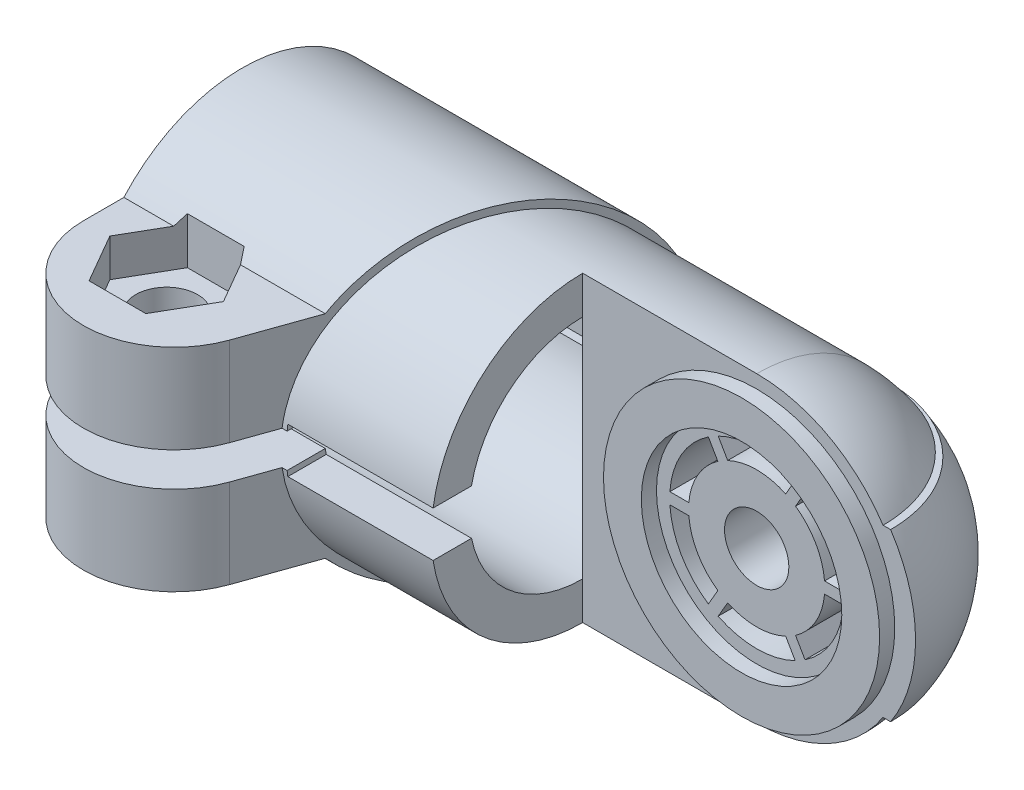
ISO-10303-21;
HEADER;
FILE_DESCRIPTION(('STEP AP214'),'2;1');
FILE_NAME('part.step','',(''),(''),'','','');
FILE_SCHEMA(('AUTOMOTIVE_DESIGN { 1 0 10303 214 1 1 1 1 }'));
ENDSEC;
DATA;
#1=APPLICATION_CONTEXT('core data for automotive mechanical design processes');
#2=APPLICATION_PROTOCOL_DEFINITION('international standard','automotive_design',2000,#1);
#3=PRODUCT_CONTEXT('',#1,'mechanical');
#4=PRODUCT('Part','Part','',(#3));
#5=PRODUCT_RELATED_PRODUCT_CATEGORY('part','',(#4));
#6=PRODUCT_DEFINITION_FORMATION('','',#4);
#7=PRODUCT_DEFINITION_CONTEXT('part definition',#1,'design');
#8=PRODUCT_DEFINITION('design','',#6,#7);
#9=PRODUCT_DEFINITION_SHAPE('','',#8);
#10=(LENGTH_UNIT() NAMED_UNIT(*) SI_UNIT(.MILLI.,.METRE.));
#11=(NAMED_UNIT(*) PLANE_ANGLE_UNIT() SI_UNIT($,.RADIAN.));
#12=(NAMED_UNIT(*) SI_UNIT($,.STERADIAN.) SOLID_ANGLE_UNIT());
#13=UNCERTAINTY_MEASURE_WITH_UNIT(LENGTH_MEASURE(1.E-05),#10,'distance_accuracy_value','');
#14=(GEOMETRIC_REPRESENTATION_CONTEXT(3) GLOBAL_UNCERTAINTY_ASSIGNED_CONTEXT((#13)) GLOBAL_UNIT_ASSIGNED_CONTEXT((#10,
#11,#12)) REPRESENTATION_CONTEXT('',''));
#15=CARTESIAN_POINT('',(0.,0.,0.));
#16=DIRECTION('',(0.,0.,1.));
#17=DIRECTION('',(1.,0.,0.));
#18=AXIS2_PLACEMENT_3D('',#15,#16,#17);
#19=CARTESIAN_POINT('',(0.,0.,0.));
#20=DIRECTION('',(1.,0.,0.));
#21=DIRECTION('',(0.,1.,0.));
#22=AXIS2_PLACEMENT_3D('',#19,#20,#21);
#23=PLANE('',#22);
#24=DIRECTION('',(0.,-1.,0.));
#25=VECTOR('',#24,1.);
#26=CARTESIAN_POINT('',(1.39645239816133E-13,-20.,0.));
#27=LINE('',#26,#25);
#28=CARTESIAN_POINT('',(-1.38777878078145E-13,20.,0.));
#29=VERTEX_POINT('',#28);
#30=CARTESIAN_POINT('',(-1.047339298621E-13,15.,0.));
#31=VERTEX_POINT('',#30);
#32=EDGE_CURVE('E26',#29,#31,#27,.T.);
#33=ORIENTED_EDGE('',*,*,#32,.F.);
#34=CARTESIAN_POINT('',(0.,0.,0.));
#35=DIRECTION('',(-1.,0.,0.));
#36=DIRECTION('',(0.,0.,1.));
#37=AXIS2_PLACEMENT_3D('',#34,#35,#36);
#38=CIRCLE('',#37,20.);
#39=CARTESIAN_POINT('',(0.,2.99999999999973,19.7737199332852));
#40=VERTEX_POINT('',#39);
#41=EDGE_CURVE('E1293',#40,#29,#38,.T.);
#42=ORIENTED_EDGE('',*,*,#41,.F.);
#43=DIRECTION('',(0.,0.,-1.));
#44=VECTOR('',#43,1.);
#45=CARTESIAN_POINT('',(0.,3.00000000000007,18.6603858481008));
#46=LINE('',#45,#44);
#47=CARTESIAN_POINT('',(0.,3.00000000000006,14.6969384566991));
#48=VERTEX_POINT('',#47);
#49=EDGE_CURVE('E882',#40,#48,#46,.T.);
#50=ORIENTED_EDGE('',*,*,#49,.T.);
#51=CARTESIAN_POINT('',(0.,0.,0.));
#52=DIRECTION('',(-1.,0.,0.));
#53=DIRECTION('',(0.,0.200000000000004,0.97979589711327));
#54=AXIS2_PLACEMENT_3D('',#51,#52,#53);
#55=CIRCLE('',#54,15.);
#56=EDGE_CURVE('E879',#48,#31,#55,.T.);
#57=ORIENTED_EDGE('',*,*,#56,.T.);
#58=EDGE_LOOP('',(#33,#42,#50,#57));
#59=FACE_BOUND('',#58,.T.);
#60=ADVANCED_FACE('F14',(#59),#23,.T.);
#61=CARTESIAN_POINT('',(1.047339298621E-13,-15.,0.));
#62=VERTEX_POINT('',#61);
#63=CARTESIAN_POINT('',(0.,-20.,0.));
#64=VERTEX_POINT('',#63);
#65=EDGE_CURVE('E9',#62,#64,#27,.T.);
#66=ORIENTED_EDGE('',*,*,#65,.F.);
#67=CARTESIAN_POINT('',(0.,0.,0.));
#68=DIRECTION('',(-1.,0.,0.));
#69=DIRECTION('',(0.,-1.,0.));
#70=AXIS2_PLACEMENT_3D('',#67,#68,#69);
#71=CIRCLE('',#70,15.);
#72=CARTESIAN_POINT('',(0.,-2.99999999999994,14.6969384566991));
#73=VERTEX_POINT('',#72);
#74=EDGE_CURVE('E892',#62,#73,#71,.T.);
#75=ORIENTED_EDGE('',*,*,#74,.T.);
#76=DIRECTION('',(0.,0.,1.));
#77=VECTOR('',#76,1.);
#78=CARTESIAN_POINT('',(0.,-2.99999999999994,14.6969384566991));
#79=LINE('',#78,#77);
#80=CARTESIAN_POINT('',(0.,-3.,19.7737199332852));
#81=VERTEX_POINT('',#80);
#82=EDGE_CURVE('E887',#81,#73,#79,.F.);
#83=ORIENTED_EDGE('',*,*,#82,.F.);
#84=EDGE_CURVE('E1298',#64,#81,#38,.T.);
#85=ORIENTED_EDGE('',*,*,#84,.F.);
#86=EDGE_LOOP('',(#66,#75,#83,#85));
#87=FACE_BOUND('',#86,.T.);
#88=ADVANCED_FACE('F1383',(#87),#23,.T.);
#89=CARTESIAN_POINT('',(-0.999999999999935,-9.,0.));
#90=DIRECTION('',(0.,-1.,0.));
#91=DIRECTION('',(1.,0.,0.));
#92=AXIS2_PLACEMENT_3D('',#89,#90,#91);
#93=PLANE('',#92);
#94=CARTESIAN_POINT('',(-34.,-9.00000000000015,21.));
#95=DIRECTION('',(0.,-1.,0.));
#96=DIRECTION('',(1.,0.,0.));
#97=AXIS2_PLACEMENT_3D('',#94,#95,#96);
#98=CIRCLE('',#97,4.1);
#99=CARTESIAN_POINT('',(-29.9,-9.00000000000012,21.));
#100=VERTEX_POINT('',#99);
#101=EDGE_CURVE('E24',#100,#100,#98,.T.);
#102=ORIENTED_EDGE('',*,*,#101,.F.);
#103=EDGE_LOOP('',(#102));
#104=FACE_BOUND('',#103,.T.);
#105=DIRECTION('',(0.499999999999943,0.,0.866025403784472));
#106=VECTOR('',#105,1.);
#107=CARTESIAN_POINT('',(-30.2472232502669,-9.00000000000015,14.5));
#108=LINE('',#107,#106);
#109=CARTESIAN_POINT('',(-30.2472232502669,-9.00000000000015,14.5));
#110=VERTEX_POINT('',#109);
#111=CARTESIAN_POINT('',(-26.494446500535,-9.0000000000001,21.));
#112=VERTEX_POINT('',#111);
#113=EDGE_CURVE('E912',#110,#112,#108,.T.);
#114=ORIENTED_EDGE('',*,*,#113,.T.);
#115=DIRECTION('',(-0.499999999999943,0.,0.866025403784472));
#116=VECTOR('',#115,1.);
#117=CARTESIAN_POINT('',(-26.494446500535,-9.0000000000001,21.));
#118=LINE('',#117,#116);
#119=CARTESIAN_POINT('',(-30.2472232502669,-9.0000000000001,27.5));
#120=VERTEX_POINT('',#119);
#121=EDGE_CURVE('E915',#112,#120,#118,.T.);
#122=ORIENTED_EDGE('',*,*,#121,.T.);
#123=DIRECTION('',(-1.,0.,0.));
#124=VECTOR('',#123,1.);
#125=CARTESIAN_POINT('',(-30.2472232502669,-9.0000000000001,27.5));
#126=LINE('',#125,#124);
#127=CARTESIAN_POINT('',(-37.7527767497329,-9.00000000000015,27.5));
#128=VERTEX_POINT('',#127);
#129=EDGE_CURVE('E918',#120,#128,#126,.T.);
#130=ORIENTED_EDGE('',*,*,#129,.T.);
#131=DIRECTION('',(-0.499999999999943,0.,-0.866025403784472));
#132=VECTOR('',#131,1.);
#133=CARTESIAN_POINT('',(-37.7527767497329,-9.00000000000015,27.5));
#134=LINE('',#133,#132);
#135=CARTESIAN_POINT('',(-41.505553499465,-9.0000000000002,21.));
#136=VERTEX_POINT('',#135);
#137=EDGE_CURVE('E921',#128,#136,#134,.T.);
#138=ORIENTED_EDGE('',*,*,#137,.T.);
#139=DIRECTION('',(0.499999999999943,0.,-0.866025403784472));
#140=VECTOR('',#139,1.);
#141=CARTESIAN_POINT('',(-41.505553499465,-9.0000000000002,21.));
#142=LINE('',#141,#140);
#143=CARTESIAN_POINT('',(-37.7527767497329,-9.0000000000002,14.5));
#144=VERTEX_POINT('',#143);
#145=EDGE_CURVE('E924',#136,#144,#142,.T.);
#146=ORIENTED_EDGE('',*,*,#145,.T.);
#147=DIRECTION('',(1.,0.,0.));
#148=VECTOR('',#147,1.);
#149=CARTESIAN_POINT('',(-37.7527767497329,-9.0000000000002,14.5));
#150=LINE('',#149,#148);
#151=EDGE_CURVE('E927',#144,#110,#150,.T.);
#152=ORIENTED_EDGE('',*,*,#151,.T.);
#153=EDGE_LOOP('',(#114,#122,#130,#138,#146,#152));
#154=FACE_BOUND('',#153,.T.);
#155=ADVANCED_FACE('F1392',(#104,#154),#93,.T.);
#156=CARTESIAN_POINT('',(-26.4944465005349,-14.,21.));
#157=DIRECTION('',(-0.866025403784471,0.,-0.499999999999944));
#158=DIRECTION('',(-0.499999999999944,0.,0.866025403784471));
#159=AXIS2_PLACEMENT_3D('',#156,#157,#158);
#160=PLANE('',#159);
#161=DIRECTION('',(0.499999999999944,0.,-0.866025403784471));
#162=VECTOR('',#161,1.);
#163=CARTESIAN_POINT('',(-30.2472232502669,-14.,27.5));
#164=LINE('',#163,#162);
#165=CARTESIAN_POINT('',(-26.4944465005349,-14.,21.));
#166=VERTEX_POINT('',#165);
#167=CARTESIAN_POINT('',(-30.2472232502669,-14.,27.5));
#168=VERTEX_POINT('',#167);
#169=EDGE_CURVE('E1236',#166,#168,#164,.F.);
#170=ORIENTED_EDGE('',*,*,#169,.T.);
#171=DIRECTION('',(0.,1.,0.));
#172=VECTOR('',#171,1.);
#173=CARTESIAN_POINT('',(-30.2472232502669,-14.,27.5));
#174=LINE('',#173,#172);
#175=EDGE_CURVE('E2323',#120,#168,#174,.F.);
#176=ORIENTED_EDGE('',*,*,#175,.F.);
#177=ORIENTED_EDGE('',*,*,#121,.F.);
#178=DIRECTION('',(0.,-1.,0.));
#179=VECTOR('',#178,1.);
#180=CARTESIAN_POINT('',(-26.494446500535,-10.,21.));
#181=LINE('',#180,#179);
#182=EDGE_CURVE('E2301',#112,#166,#181,.T.);
#183=ORIENTED_EDGE('',*,*,#182,.T.);
#184=EDGE_LOOP('',(#170,#176,#177,#183));
#185=FACE_BOUND('',#184,.T.);
#186=ADVANCED_FACE('F1400',(#185),#160,.T.);
#187=CARTESIAN_POINT('',(-30.2472232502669,-10.,27.5));
#188=DIRECTION('',(0.,0.,-1.));
#189=DIRECTION('',(0.,-1.,0.));
#190=AXIS2_PLACEMENT_3D('',#187,#188,#189);
#191=PLANE('',#190);
#192=DIRECTION('',(1.,0.,0.));
#193=VECTOR('',#192,1.);
#194=CARTESIAN_POINT('',(-37.7527767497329,-14.0000000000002,27.5));
#195=LINE('',#194,#193);
#196=CARTESIAN_POINT('',(-37.7527767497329,-14.0000000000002,27.5));
#197=VERTEX_POINT('',#196);
#198=EDGE_CURVE('E1232',#168,#197,#195,.F.);
#199=ORIENTED_EDGE('',*,*,#198,.T.);
#200=DIRECTION('',(0.,-1.,0.));
#201=VECTOR('',#200,1.);
#202=CARTESIAN_POINT('',(-37.7527767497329,-10.0000000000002,27.5));
#203=LINE('',#202,#201);
#204=EDGE_CURVE('E1297',#128,#197,#203,.T.);
#205=ORIENTED_EDGE('',*,*,#204,.F.);
#206=ORIENTED_EDGE('',*,*,#129,.F.);
#207=ORIENTED_EDGE('',*,*,#175,.T.);
#208=EDGE_LOOP('',(#199,#205,#206,#207));
#209=FACE_BOUND('',#208,.T.);
#210=ADVANCED_FACE('F1406',(#209),#191,.T.);
#211=CARTESIAN_POINT('',(-37.7527767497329,-14.0000000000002,27.5));
#212=DIRECTION('',(0.866025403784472,0.,-0.499999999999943));
#213=DIRECTION('',(-0.499999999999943,0.,-0.866025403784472));
#214=AXIS2_PLACEMENT_3D('',#211,#212,#213);
#215=PLANE('',#214);
#216=DIRECTION('',(0.499999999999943,0.,0.866025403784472));
#217=VECTOR('',#216,1.);
#218=CARTESIAN_POINT('',(-41.5055534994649,-14.0000000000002,21.));
#219=LINE('',#218,#217);
#220=CARTESIAN_POINT('',(-41.5055534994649,-14.0000000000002,21.));
#221=VERTEX_POINT('',#220);
#222=EDGE_CURVE('E1228',#197,#221,#219,.F.);
#223=ORIENTED_EDGE('',*,*,#222,.T.);
#224=DIRECTION('',(0.,-1.,0.));
#225=VECTOR('',#224,1.);
#226=CARTESIAN_POINT('',(-41.505553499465,-10.0000000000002,21.));
#227=LINE('',#226,#225);
#228=EDGE_CURVE('E1300',#136,#221,#227,.T.);
#229=ORIENTED_EDGE('',*,*,#228,.F.);
#230=ORIENTED_EDGE('',*,*,#137,.F.);
#231=ORIENTED_EDGE('',*,*,#204,.T.);
#232=EDGE_LOOP('',(#223,#229,#230,#231));
#233=FACE_BOUND('',#232,.T.);
#234=ADVANCED_FACE('F2037',(#233),#215,.T.);
#235=CARTESIAN_POINT('',(-41.5055534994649,-15.1904575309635,21.));
#236=DIRECTION('',(0.866025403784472,0.,0.499999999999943));
#237=DIRECTION('',(0.499999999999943,0.,-0.866025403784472));
#238=AXIS2_PLACEMENT_3D('',#235,#236,#237);
#239=PLANE('',#238);
#240=CARTESIAN_POINT('',(-38.4181588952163,-14.0000001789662,15.6524756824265));
#241=CARTESIAN_POINT('',(-38.2054929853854,-14.4118259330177,15.2841275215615));
#242=CARTESIAN_POINT('',(-37.9835262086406,-14.8089540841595,14.8996697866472));
#243=CARTESIAN_POINT('',(-37.7527767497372,-15.1904575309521,14.5000000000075));
#244=B_SPLINE_CURVE_WITH_KNOTS('',3,(#240,#241,#242,#243),.UNSPECIFIED.,.F.,.F.,(4,4),(0.,1.),.UNSPECIFIED.);
#245=CARTESIAN_POINT('',(-38.4181588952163,-14.0000001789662,15.6524756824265));
#246=VERTEX_POINT('',#245);
#247=CARTESIAN_POINT('',(-37.7527767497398,-15.1904575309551,14.5000000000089));
#248=VERTEX_POINT('',#247);
#249=EDGE_CURVE('E1098',#246,#248,#244,.T.);
#250=ORIENTED_EDGE('',*,*,#249,.T.);
#251=DIRECTION('',(-1.32088929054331E-12,-1.,0.));
#252=VECTOR('',#251,1.);
#253=CARTESIAN_POINT('',(-37.7527767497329,-10.0000000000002,14.5));
#254=LINE('',#253,#252);
#255=EDGE_CURVE('E2327',#144,#248,#254,.T.);
#256=ORIENTED_EDGE('',*,*,#255,.F.);
#257=ORIENTED_EDGE('',*,*,#145,.F.);
#258=ORIENTED_EDGE('',*,*,#228,.T.);
#259=DIRECTION('',(-0.499999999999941,0.,0.866025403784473));
#260=VECTOR('',#259,1.);
#261=CARTESIAN_POINT('',(-38.4181588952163,-14.0000000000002,15.6524756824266));
#262=LINE('',#261,#260);
#263=EDGE_CURVE('E1224',#221,#246,#262,.F.);
#264=ORIENTED_EDGE('',*,*,#263,.T.);
#265=EDGE_LOOP('',(#250,#256,#257,#258,#264));
#266=FACE_BOUND('',#265,.T.);
#267=ADVANCED_FACE('F2046',(#266),#239,.T.);
#268=CARTESIAN_POINT('',(-30.2472232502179,-15.190457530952,14.5));
#269=DIRECTION('',(0.,0.,1.));
#270=DIRECTION('',(0.,1.,0.));
#271=AXIS2_PLACEMENT_3D('',#268,#269,#270);
#272=PLANE('',#271);
#273=DIRECTION('',(-1.,-9.67670437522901E-12,-1.01302857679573E-11));
#274=VECTOR('',#273,1.);
#275=CARTESIAN_POINT('',(-30.2472232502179,-15.1904575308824,14.5000000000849));
#276=LINE('',#275,#274);
#277=CARTESIAN_POINT('',(-30.2472232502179,-15.1904575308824,14.5000000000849));
#278=VERTEX_POINT('',#277);
#279=EDGE_CURVE('E1067',#248,#278,#276,.F.);
#280=ORIENTED_EDGE('',*,*,#279,.T.);
#281=DIRECTION('',(-9.44582748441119E-12,1.,0.));
#282=VECTOR('',#281,1.);
#283=CARTESIAN_POINT('',(-30.2472232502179,-15.1904575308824,14.5));
#284=LINE('',#283,#282);
#285=EDGE_CURVE('E2331',#110,#278,#284,.F.);
#286=ORIENTED_EDGE('',*,*,#285,.F.);
#287=ORIENTED_EDGE('',*,*,#151,.F.);
#288=ORIENTED_EDGE('',*,*,#255,.T.);
#289=EDGE_LOOP('',(#280,#286,#287,#288));
#290=FACE_BOUND('',#289,.T.);
#291=ADVANCED_FACE('F2054',(#290),#272,.T.);
#292=CARTESIAN_POINT('',(-30.2472232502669,-15.1904575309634,14.5));
#293=DIRECTION('',(-0.866025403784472,0.,0.499999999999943));
#294=DIRECTION('',(0.499999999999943,0.,0.866025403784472));
#295=AXIS2_PLACEMENT_3D('',#292,#293,#294);
#296=PLANE('',#295);
#297=CARTESIAN_POINT('',(-30.2472232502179,-15.1904575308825,14.5000000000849));
#298=CARTESIAN_POINT('',(-30.0164737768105,-14.8089540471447,14.8996698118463));
#299=CARTESIAN_POINT('',(-29.794506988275,-14.4118258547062,15.2841275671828));
#300=CARTESIAN_POINT('',(-29.581841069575,-14.0000000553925,15.6524757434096));
#301=B_SPLINE_CURVE_WITH_KNOTS('',3,(#297,#298,#299,#300),.UNSPECIFIED.,.F.,.F.,(4,4),(0.,1.),.UNSPECIFIED.);
#302=CARTESIAN_POINT('',(-29.581841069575,-14.0000000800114,15.6524757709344));
#303=VERTEX_POINT('',#302);
#304=EDGE_CURVE('E1078',#278,#303,#301,.T.);
#305=ORIENTED_EDGE('',*,*,#304,.T.);
#306=DIRECTION('',(-0.499999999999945,0.,-0.866025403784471));
#307=VECTOR('',#306,1.);
#308=CARTESIAN_POINT('',(-26.4944465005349,-14.,21.));
#309=LINE('',#308,#307);
#310=EDGE_CURVE('E1208',#303,#166,#309,.F.);
#311=ORIENTED_EDGE('',*,*,#310,.T.);
#312=ORIENTED_EDGE('',*,*,#182,.F.);
#313=ORIENTED_EDGE('',*,*,#113,.F.);
#314=ORIENTED_EDGE('',*,*,#285,.T.);
#315=EDGE_LOOP('',(#305,#311,#312,#313,#314));
#316=FACE_BOUND('',#315,.T.);
#317=ADVANCED_FACE('F1374',(#316),#296,.T.);
#318=CARTESIAN_POINT('',(-30.2472232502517,9.99999999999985,14.5));
#319=DIRECTION('',(0.,0.,1.));
#320=DIRECTION('',(0.,1.,0.));
#321=AXIS2_PLACEMENT_3D('',#318,#319,#320);
#322=PLANE('',#321);
#323=DIRECTION('',(1.,-1.53807419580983E-11,1.61202257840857E-11));
#324=VECTOR('',#323,1.);
#325=CARTESIAN_POINT('',(-37.7527767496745,15.1904575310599,14.4999999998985));
#326=LINE('',#325,#324);
#327=CARTESIAN_POINT('',(-30.2472232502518,15.1904575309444,14.5000000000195));
#328=VERTEX_POINT('',#327);
#329=CARTESIAN_POINT('',(-37.7527767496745,15.1904575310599,14.4999999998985));
#330=VERTEX_POINT('',#329);
#331=EDGE_CURVE('E1125',#328,#330,#326,.F.);
#332=ORIENTED_EDGE('',*,*,#331,.T.);
#333=DIRECTION('',(-1.1270348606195E-11,-1.,0.));
#334=VECTOR('',#333,1.);
#335=CARTESIAN_POINT('',(-37.7527767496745,15.1904575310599,14.5));
#336=LINE('',#335,#334);
#337=CARTESIAN_POINT('',(-37.7527767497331,9.99999999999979,14.5));
#338=VERTEX_POINT('',#337);
#339=EDGE_CURVE('E1136',#330,#338,#336,.T.);
#340=ORIENTED_EDGE('',*,*,#339,.T.);
#341=DIRECTION('',(0.,1.,0.));
#342=VECTOR('',#341,1.);
#343=CARTESIAN_POINT('',(-37.7527767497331,8.99999999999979,14.5));
#344=LINE('',#343,#342);
#345=CARTESIAN_POINT('',(-37.7527767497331,8.99999999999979,14.5));
#346=VERTEX_POINT('',#345);
#347=EDGE_CURVE('E951',#346,#338,#344,.T.);
#348=ORIENTED_EDGE('',*,*,#347,.F.);
#349=DIRECTION('',(-1.,0.,0.));
#350=VECTOR('',#349,1.);
#351=CARTESIAN_POINT('',(-30.2472232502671,8.99999999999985,14.5));
#352=LINE('',#351,#350);
#353=CARTESIAN_POINT('',(-30.2472232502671,8.99999999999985,14.5));
#354=VERTEX_POINT('',#353);
#355=EDGE_CURVE('E942',#354,#346,#352,.T.);
#356=ORIENTED_EDGE('',*,*,#355,.F.);
#357=DIRECTION('',(2.94582162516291E-12,1.,0.));
#358=VECTOR('',#357,1.);
#359=CARTESIAN_POINT('',(-30.2472232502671,9.99999999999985,14.5));
#360=LINE('',#359,#358);
#361=EDGE_CURVE('E1138',#328,#354,#360,.F.);
#362=ORIENTED_EDGE('',*,*,#361,.F.);
#363=EDGE_LOOP('',(#332,#340,#348,#356,#362));
#364=FACE_BOUND('',#363,.T.);
#365=ADVANCED_FACE('F1135',(#364),#322,.T.);
#366=CARTESIAN_POINT('',(-41.505553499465,9.99999999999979,21.));
#367=DIRECTION('',(0.866025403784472,0.,0.499999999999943));
#368=DIRECTION('',(0.499999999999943,0.,-0.866025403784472));
#369=AXIS2_PLACEMENT_3D('',#366,#367,#368);
#370=PLANE('',#369);
#371=CARTESIAN_POINT('',(-37.7527767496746,15.1904575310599,14.4999999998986));
#372=CARTESIAN_POINT('',(-37.983526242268,14.8089540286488,14.8996698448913));
#373=CARTESIAN_POINT('',(-38.2054930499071,14.4118258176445,15.2841276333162));
#374=CARTESIAN_POINT('',(-38.4181589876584,13.9999999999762,15.6524758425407));
#375=B_SPLINE_CURVE_WITH_KNOTS('',3,(#371,#372,#373,#374),.UNSPECIFIED.,.F.,.F.,(4,4),(0.,1.),.UNSPECIFIED.);
#376=CARTESIAN_POINT('',(-38.4181589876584,13.9999999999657,15.6524758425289));
#377=VERTEX_POINT('',#376);
#378=EDGE_CURVE('E1119',#330,#377,#375,.T.);
#379=ORIENTED_EDGE('',*,*,#378,.T.);
#380=DIRECTION('',(0.499999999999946,0.,-0.86602540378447));
#381=VECTOR('',#380,1.);
#382=CARTESIAN_POINT('',(-41.5055534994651,13.9999999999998,21.));
#383=LINE('',#382,#381);
#384=CARTESIAN_POINT('',(-41.5055534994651,13.9999999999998,21.));
#385=VERTEX_POINT('',#384);
#386=EDGE_CURVE('E1258',#385,#377,#383,.T.);
#387=ORIENTED_EDGE('',*,*,#386,.F.);
#388=DIRECTION('',(0.,-1.,0.));
#389=VECTOR('',#388,1.);
#390=CARTESIAN_POINT('',(-41.5055534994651,13.9999999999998,21.));
#391=LINE('',#390,#389);
#392=CARTESIAN_POINT('',(-41.505553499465,8.99999999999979,21.));
#393=VERTEX_POINT('',#392);
#394=EDGE_CURVE('E2343',#385,#393,#391,.T.);
#395=ORIENTED_EDGE('',*,*,#394,.T.);
#396=DIRECTION('',(-0.499999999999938,0.,0.866025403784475));
#397=VECTOR('',#396,1.);
#398=CARTESIAN_POINT('',(-37.7527767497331,8.99999999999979,14.5));
#399=LINE('',#398,#397);
#400=EDGE_CURVE('E945',#346,#393,#399,.T.);
#401=ORIENTED_EDGE('',*,*,#400,.F.);
#402=ORIENTED_EDGE('',*,*,#347,.T.);
#403=ORIENTED_EDGE('',*,*,#339,.F.);
#404=EDGE_LOOP('',(#379,#387,#395,#401,#402,#403));
#405=FACE_BOUND('',#404,.T.);
#406=ADVANCED_FACE('F1369',(#405),#370,.T.);
#407=CARTESIAN_POINT('',(-37.7527767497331,9.99999999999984,27.5));
#408=DIRECTION('',(0.866025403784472,0.,-0.499999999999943));
#409=DIRECTION('',(-0.499999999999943,0.,-0.866025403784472));
#410=AXIS2_PLACEMENT_3D('',#407,#408,#409);
#411=PLANE('',#410);
#412=DIRECTION('',(0.,-1.,0.));
#413=VECTOR('',#412,1.);
#414=CARTESIAN_POINT('',(-37.7527767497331,13.9999999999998,27.5));
#415=LINE('',#414,#413);
#416=CARTESIAN_POINT('',(-37.7527767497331,13.9999999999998,27.5));
#417=VERTEX_POINT('',#416);
#418=CARTESIAN_POINT('',(-37.7527767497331,8.99999999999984,27.5));
#419=VERTEX_POINT('',#418);
#420=EDGE_CURVE('E2335',#417,#419,#415,.T.);
#421=ORIENTED_EDGE('',*,*,#420,.T.);
#422=DIRECTION('',(0.499999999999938,0.,0.866025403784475));
#423=VECTOR('',#422,1.);
#424=CARTESIAN_POINT('',(-41.505553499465,8.99999999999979,21.));
#425=LINE('',#424,#423);
#426=EDGE_CURVE('E948',#393,#419,#425,.T.);
#427=ORIENTED_EDGE('',*,*,#426,.F.);
#428=ORIENTED_EDGE('',*,*,#394,.F.);
#429=DIRECTION('',(-0.499999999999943,0.,-0.866025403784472));
#430=VECTOR('',#429,1.);
#431=CARTESIAN_POINT('',(-37.7527767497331,13.9999999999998,27.5));
#432=LINE('',#431,#430);
#433=EDGE_CURVE('E1253',#417,#385,#432,.T.);
#434=ORIENTED_EDGE('',*,*,#433,.F.);
#435=EDGE_LOOP('',(#421,#427,#428,#434));
#436=FACE_BOUND('',#435,.T.);
#437=ADVANCED_FACE('F2058',(#436),#411,.T.);
#438=CARTESIAN_POINT('',(-30.2472232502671,14.,27.5));
#439=DIRECTION('',(0.,0.,-1.));
#440=DIRECTION('',(0.,-1.,0.));
#441=AXIS2_PLACEMENT_3D('',#438,#439,#440);
#442=PLANE('',#441);
#443=DIRECTION('',(0.,1.,0.));
#444=VECTOR('',#443,1.);
#445=CARTESIAN_POINT('',(-30.2472232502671,9.99999999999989,27.5));
#446=LINE('',#445,#444);
#447=CARTESIAN_POINT('',(-30.2472232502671,14.,27.5));
#448=VERTEX_POINT('',#447);
#449=CARTESIAN_POINT('',(-30.2472232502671,8.99999999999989,27.5));
#450=VERTEX_POINT('',#449);
#451=EDGE_CURVE('E2339',#448,#450,#446,.F.);
#452=ORIENTED_EDGE('',*,*,#451,.T.);
#453=DIRECTION('',(1.,0.,0.));
#454=VECTOR('',#453,1.);
#455=CARTESIAN_POINT('',(-37.7527767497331,8.99999999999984,27.5));
#456=LINE('',#455,#454);
#457=EDGE_CURVE('E933',#419,#450,#456,.T.);
#458=ORIENTED_EDGE('',*,*,#457,.F.);
#459=ORIENTED_EDGE('',*,*,#420,.F.);
#460=DIRECTION('',(-1.,0.,0.));
#461=VECTOR('',#460,1.);
#462=CARTESIAN_POINT('',(-30.2472232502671,14.,27.5));
#463=LINE('',#462,#461);
#464=EDGE_CURVE('E1248',#448,#417,#463,.T.);
#465=ORIENTED_EDGE('',*,*,#464,.F.);
#466=EDGE_LOOP('',(#452,#458,#459,#465));
#467=FACE_BOUND('',#466,.T.);
#468=ADVANCED_FACE('F2063',(#467),#442,.T.);
#469=CARTESIAN_POINT('',(-26.4944465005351,10.,21.));
#470=DIRECTION('',(-0.866025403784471,0.,-0.499999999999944));
#471=DIRECTION('',(-0.499999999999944,0.,0.866025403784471));
#472=AXIS2_PLACEMENT_3D('',#469,#470,#471);
#473=PLANE('',#472);
#474=DIRECTION('',(0.,1.,0.));
#475=VECTOR('',#474,1.);
#476=CARTESIAN_POINT('',(-26.4944465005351,10.,21.));
#477=LINE('',#476,#475);
#478=CARTESIAN_POINT('',(-26.4944465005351,14.,21.));
#479=VERTEX_POINT('',#478);
#480=CARTESIAN_POINT('',(-26.4944465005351,8.99999999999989,21.));
#481=VERTEX_POINT('',#480);
#482=EDGE_CURVE('E1349',#479,#481,#477,.F.);
#483=ORIENTED_EDGE('',*,*,#482,.T.);
#484=DIRECTION('',(0.499999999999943,0.,-0.866025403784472));
#485=VECTOR('',#484,1.);
#486=CARTESIAN_POINT('',(-30.2472232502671,8.99999999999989,27.5));
#487=LINE('',#486,#485);
#488=EDGE_CURVE('E936',#450,#481,#487,.T.);
#489=ORIENTED_EDGE('',*,*,#488,.F.);
#490=ORIENTED_EDGE('',*,*,#451,.F.);
#491=DIRECTION('',(-0.499999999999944,0.,0.866025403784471));
#492=VECTOR('',#491,1.);
#493=CARTESIAN_POINT('',(-26.4944465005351,14.,21.));
#494=LINE('',#493,#492);
#495=EDGE_CURVE('E1244',#479,#448,#494,.T.);
#496=ORIENTED_EDGE('',*,*,#495,.F.);
#497=EDGE_LOOP('',(#483,#489,#490,#496));
#498=FACE_BOUND('',#497,.T.);
#499=ADVANCED_FACE('F1368',(#498),#473,.T.);
#500=CARTESIAN_POINT('',(-30.2472232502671,9.99999999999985,14.5));
#501=DIRECTION('',(-0.866025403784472,0.,0.499999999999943));
#502=DIRECTION('',(0.499999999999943,0.,0.866025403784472));
#503=AXIS2_PLACEMENT_3D('',#500,#501,#502);
#504=PLANE('',#503);
#505=CARTESIAN_POINT('',(-29.581841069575,14.0000001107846,15.6524757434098));
#506=CARTESIAN_POINT('',(-29.794506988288,14.4118258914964,15.2841275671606));
#507=CARTESIAN_POINT('',(-30.0164737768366,14.8089540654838,14.8996698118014));
#508=CARTESIAN_POINT('',(-30.2472232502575,15.1904575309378,14.5000000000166));
#509=B_SPLINE_CURVE_WITH_KNOTS('',3,(#505,#506,#507,#508),.UNSPECIFIED.,.F.,.F.,(4,4),(0.,1.),.UNSPECIFIED.);
#510=CARTESIAN_POINT('',(-29.5818410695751,14.0000001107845,15.6524757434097));
#511=VERTEX_POINT('',#510);
#512=EDGE_CURVE('E1139',#511,#328,#509,.T.);
#513=ORIENTED_EDGE('',*,*,#512,.T.);
#514=ORIENTED_EDGE('',*,*,#361,.T.);
#515=DIRECTION('',(-0.499999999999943,0.,-0.866025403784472));
#516=VECTOR('',#515,1.);
#517=CARTESIAN_POINT('',(-26.4944465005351,8.99999999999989,21.));
#518=LINE('',#517,#516);
#519=EDGE_CURVE('E939',#481,#354,#518,.T.);
#520=ORIENTED_EDGE('',*,*,#519,.F.);
#521=ORIENTED_EDGE('',*,*,#482,.F.);
#522=DIRECTION('',(0.499999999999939,0.,0.866025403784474));
#523=VECTOR('',#522,1.);
#524=CARTESIAN_POINT('',(-29.5818410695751,13.9999999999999,15.6524757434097));
#525=LINE('',#524,#523);
#526=EDGE_CURVE('E1152',#511,#479,#525,.T.);
#527=ORIENTED_EDGE('',*,*,#526,.F.);
#528=EDGE_LOOP('',(#513,#514,#520,#521,#527));
#529=FACE_BOUND('',#528,.T.);
#530=ADVANCED_FACE('F1357',(#529),#504,.T.);
#531=CARTESIAN_POINT('',(-1.00000000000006,9.,0.));
#532=DIRECTION('',(0.,1.,0.));
#533=DIRECTION('',(-1.,0.,0.));
#534=AXIS2_PLACEMENT_3D('',#531,#532,#533);
#535=PLANE('',#534);
#536=CARTESIAN_POINT('',(-34.,8.99999999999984,21.));
#537=DIRECTION('',(0.,1.,0.));
#538=DIRECTION('',(-1.,0.,0.));
#539=AXIS2_PLACEMENT_3D('',#536,#537,#538);
#540=CIRCLE('',#539,4.1);
#541=CARTESIAN_POINT('',(-38.1,8.99999999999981,21.));
#542=VERTEX_POINT('',#541);
#543=EDGE_CURVE('E930',#542,#542,#540,.T.);
#544=ORIENTED_EDGE('',*,*,#543,.F.);
#545=EDGE_LOOP('',(#544));
#546=FACE_BOUND('',#545,.T.);
#547=ORIENTED_EDGE('',*,*,#457,.T.);
#548=ORIENTED_EDGE('',*,*,#488,.T.);
#549=ORIENTED_EDGE('',*,*,#519,.T.);
#550=ORIENTED_EDGE('',*,*,#355,.T.);
#551=ORIENTED_EDGE('',*,*,#400,.T.);
#552=ORIENTED_EDGE('',*,*,#426,.T.);
#553=EDGE_LOOP('',(#547,#548,#549,#550,#551,#552));
#554=FACE_BOUND('',#553,.T.);
#555=ADVANCED_FACE('F1367',(#546,#554),#535,.T.);
#556=CARTESIAN_POINT('',(-34.0000000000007,100.,20.9999999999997));
#557=DIRECTION('',(0.,-1.,0.));
#558=DIRECTION('',(-1.,0.,0.));
#559=AXIS2_PLACEMENT_3D('',#556,#557,#558);
#560=CYLINDRICAL_SURFACE('',#559,4.1);
#561=CARTESIAN_POINT('',(-34.,-2.25000000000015,21.));
#562=DIRECTION('',(0.,-1.,0.));
#563=DIRECTION('',(-1.,0.,0.));
#564=AXIS2_PLACEMENT_3D('',#561,#562,#563);
#565=CIRCLE('',#564,4.1);
#566=CARTESIAN_POINT('',(-38.1,-2.25000000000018,21.));
#567=VERTEX_POINT('',#566);
#568=EDGE_CURVE('E2274',#567,#567,#565,.T.);
#569=ORIENTED_EDGE('',*,*,#568,.F.);
#570=EDGE_LOOP('',(#569));
#571=FACE_BOUND('',#570,.T.);
#572=ORIENTED_EDGE('',*,*,#101,.T.);
#573=EDGE_LOOP('',(#572));
#574=FACE_BOUND('',#573,.T.);
#575=ADVANCED_FACE('F1414',(#571,#574),#560,.F.);
#576=CARTESIAN_POINT('',(-33.,13.9999999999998,21.));
#577=DIRECTION('',(0.,-1.,0.));
#578=DIRECTION('',(0.942661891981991,0.,0.333749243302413));
#579=AXIS2_PLACEMENT_3D('',#576,#577,#578);
#580=CYLINDRICAL_SURFACE('',#579,12.);
#581=CARTESIAN_POINT('',(-33.,-2.25000000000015,21.));
#582=DIRECTION('',(0.,1.,0.));
#583=DIRECTION('',(-1.,0.,0.));
#584=AXIS2_PLACEMENT_3D('',#581,#582,#583);
#585=CIRCLE('',#584,12.);
#586=CARTESIAN_POINT('',(-45.,-2.25000000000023,21.));
#587=VERTEX_POINT('',#586);
#588=CARTESIAN_POINT('',(-21.6880572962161,-2.25000000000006,25.004990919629));
#589=VERTEX_POINT('',#588);
#590=EDGE_CURVE('E2262',#587,#589,#585,.T.);
#591=ORIENTED_EDGE('',*,*,#590,.F.);
#592=DIRECTION('',(0.,1.,0.));
#593=VECTOR('',#592,1.);
#594=CARTESIAN_POINT('',(-45.,-14.0000000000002,21.));
#595=LINE('',#594,#593);
#596=CARTESIAN_POINT('',(-45.,-14.0000000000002,21.));
#597=VERTEX_POINT('',#596);
#598=EDGE_CURVE('E2277',#587,#597,#595,.F.);
#599=ORIENTED_EDGE('',*,*,#598,.T.);
#600=CARTESIAN_POINT('',(-33.,-14.0000000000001,21.));
#601=DIRECTION('',(0.,-1.,0.));
#602=DIRECTION('',(0.942661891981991,0.,0.333749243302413));
#603=AXIS2_PLACEMENT_3D('',#600,#601,#602);
#604=CIRCLE('',#603,12.);
#605=CARTESIAN_POINT('',(-21.6880572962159,-14.,25.004990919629));
#606=VERTEX_POINT('',#605);
#607=EDGE_CURVE('E1211',#597,#606,#604,.F.);
#608=ORIENTED_EDGE('',*,*,#607,.T.);
#609=DIRECTION('',(0.,-1.,0.));
#610=VECTOR('',#609,1.);
#611=CARTESIAN_POINT('',(-21.6880572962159,-2.25000000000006,25.004990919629));
#612=LINE('',#611,#610);
#613=EDGE_CURVE('E1336',#589,#606,#612,.T.);
#614=ORIENTED_EDGE('',*,*,#613,.F.);
#615=EDGE_LOOP('',(#591,#599,#608,#614));
#616=FACE_BOUND('',#615,.T.);
#617=ADVANCED_FACE('F2129',(#616),#580,.T.);
#618=CARTESIAN_POINT('',(-18.3768012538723,-14.,15.6524756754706));
#619=DIRECTION('',(0.,-1.,0.));
#620=DIRECTION('',(0.,0.,1.));
#621=AXIS2_PLACEMENT_3D('',#618,#619,#620);
#622=PLANE('',#621);
#623=ORIENTED_EDGE('',*,*,#310,.F.);
#624=DIRECTION('',(-1.,9.52532434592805E-09,8.51971527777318E-09));
#625=VECTOR('',#624,1.);
#626=CARTESIAN_POINT('',(-18.3768012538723,-14.000000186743,15.6524756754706));
#627=LINE('',#626,#625);
#628=CARTESIAN_POINT('',(-18.3768012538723,-14.000000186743,15.6524756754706));
#629=VERTEX_POINT('',#628);
#630=EDGE_CURVE('E1082',#303,#629,#627,.F.);
#631=ORIENTED_EDGE('',*,*,#630,.T.);
#632=DIRECTION('',(-0.333749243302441,0.,0.942661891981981));
#633=VECTOR('',#632,1.);
#634=CARTESIAN_POINT('',(-18.3768012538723,-14.,15.6524756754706));
#635=LINE('',#634,#633);
#636=EDGE_CURVE('E1209',#606,#629,#635,.F.);
#637=ORIENTED_EDGE('',*,*,#636,.F.);
#638=ORIENTED_EDGE('',*,*,#607,.F.);
#639=DIRECTION('',(0.,0.,-1.));
#640=VECTOR('',#639,1.);
#641=CARTESIAN_POINT('',(-45.,-14.0000000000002,21.));
#642=LINE('',#641,#640);
#643=CARTESIAN_POINT('',(-45.,-14.0000000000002,15.6524758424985));
#644=VERTEX_POINT('',#643);
#645=EDGE_CURVE('E1219',#644,#597,#642,.F.);
#646=ORIENTED_EDGE('',*,*,#645,.F.);
#647=DIRECTION('',(-1.,2.71908610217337E-08,2.43202516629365E-08));
#648=VECTOR('',#647,1.);
#649=CARTESIAN_POINT('',(-38.4181588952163,-14.0000001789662,15.6524756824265));
#650=LINE('',#649,#648);
#651=EDGE_CURVE('E1101',#644,#246,#650,.F.);
#652=ORIENTED_EDGE('',*,*,#651,.T.);
#653=ORIENTED_EDGE('',*,*,#263,.F.);
#654=ORIENTED_EDGE('',*,*,#222,.F.);
#655=ORIENTED_EDGE('',*,*,#198,.F.);
#656=ORIENTED_EDGE('',*,*,#169,.F.);
#657=EDGE_LOOP('',(#623,#631,#637,#638,#646,#652,#653,#654,#655,#656));
#658=FACE_BOUND('',#657,.T.);
#659=ADVANCED_FACE('F1027',(#658),#622,.T.);
#660=CARTESIAN_POINT('',(-45.,-3.07250357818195E-13,0.));
#661=DIRECTION('',(-1.,0.,0.));
#662=DIRECTION('',(0.,3.12283532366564E-12,-1.));
#663=AXIS2_PLACEMENT_3D('',#660,#661,#662);
#664=CYLINDRICAL_SURFACE('',#663,21.);
#665=ORIENTED_EDGE('',*,*,#651,.F.);
#666=CARTESIAN_POINT('',(-45.,-3.07250357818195E-13,0.));
#667=DIRECTION('',(1.,0.,0.));
#668=DIRECTION('',(0.,-0.666666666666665,0.745355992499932));
#669=AXIS2_PLACEMENT_3D('',#666,#667,#668);
#670=CIRCLE('',#669,21.);
#671=CARTESIAN_POINT('',(-45.,13.9999999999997,15.6524758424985));
#672=VERTEX_POINT('',#671);
#673=EDGE_CURVE('E1106',#672,#644,#670,.F.);
#674=ORIENTED_EDGE('',*,*,#673,.F.);
#675=DIRECTION('',(1.,-5.16838038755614E-12,4.62911098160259E-12));
#676=VECTOR('',#675,1.);
#677=CARTESIAN_POINT('',(-45.,13.9999999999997,15.6524758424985));
#678=LINE('',#677,#676);
#679=EDGE_CURVE('E1110',#672,#377,#678,.T.);
#680=ORIENTED_EDGE('',*,*,#679,.T.);
#681=ORIENTED_EDGE('',*,*,#378,.F.);
#682=ORIENTED_EDGE('',*,*,#331,.F.);
#683=ORIENTED_EDGE('',*,*,#512,.F.);
#684=DIRECTION('',(1.,-9.62312259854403E-09,8.60718865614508E-09));
#685=VECTOR('',#684,1.);
#686=CARTESIAN_POINT('',(-29.5818410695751,14.0000001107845,15.6524757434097));
#687=LINE('',#686,#685);
#688=CARTESIAN_POINT('',(-18.3768013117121,14.000000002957,15.6524758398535));
#689=VERTEX_POINT('',#688);
#690=EDGE_CURVE('E1140',#511,#689,#687,.T.);
#691=ORIENTED_EDGE('',*,*,#690,.T.);
#692=CARTESIAN_POINT('',(-5.96064221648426,8.00000048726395,-19.4164876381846));
#693=CARTESIAN_POINT('',(-6.30627257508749,10.3693449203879,-18.4402679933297));
#694=CARTESIAN_POINT('',(-6.80252068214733,12.5400055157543,-17.0386343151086));
#695=CARTESIAN_POINT('',(-7.98592250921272,16.0857868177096,-13.6961614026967));
#696=CARTESIAN_POINT('',(-8.64198947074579,17.4955904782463,-11.8431255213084));
#697=CARTESIAN_POINT('',(-10.1077021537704,19.679461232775,-7.70327646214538));
#698=CARTESIAN_POINT('',(-10.91111217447,20.4262796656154,-5.434075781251));
#699=CARTESIAN_POINT('',(-12.4348270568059,21.0603345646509,-1.13040174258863));
#700=CARTESIAN_POINT('',(-13.1247575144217,21.073127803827,0.818280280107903));
#701=CARTESIAN_POINT('',(-14.4807890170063,20.5700766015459,4.64833906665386));
#702=CARTESIAN_POINT('',(-15.1468900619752,20.0542321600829,6.52971583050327));
#703=CARTESIAN_POINT('',(-16.466235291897,18.4458794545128,10.2561556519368));
#704=CARTESIAN_POINT('',(-17.1035104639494,17.3241699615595,12.0561148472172));
#705=CARTESIAN_POINT('',(-17.9208254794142,15.3469544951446,14.3645896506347));
#706=CARTESIAN_POINT('',(-18.1567529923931,14.694878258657,15.0309578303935));
#707=CARTESIAN_POINT('',(-18.3768013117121,14.0000000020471,15.6524758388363));
#708=B_SPLINE_CURVE_WITH_KNOTS('',3,(#692,#693,#694,#695,#696,#697,#698,#699,#700,#701,#702,
#703,#704,#705,#706,#707),.UNSPECIFIED.,.F.,.F.,(4,2,2,2,2,2,2,4),(0.,0.182064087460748,
0.346202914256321,0.514740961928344,0.651339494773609,0.787938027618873,0.93539626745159,1.),.UNSPECIFIED.);
#709=CARTESIAN_POINT('',(-5.96064214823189,8.00000001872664,-19.4164878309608));
#710=VERTEX_POINT('',#709);
#711=EDGE_CURVE('E1156',#710,#689,#708,.T.);
#712=ORIENTED_EDGE('',*,*,#711,.F.);
#713=CARTESIAN_POINT('',(-12.8350455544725,0.,0.));
#714=DIRECTION('',(0.942661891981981,0.,0.333749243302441));
#715=DIRECTION('',(-0.333749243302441,0.,0.942661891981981));
#716=AXIS2_PLACEMENT_3D('',#713,#714,#715);
#717=ELLIPSE('',#716,22.2773405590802,20.9999999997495);
#718=CARTESIAN_POINT('',(-5.75404978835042,6.40312423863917,-19.9999999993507));
#719=VERTEX_POINT('',#718);
#720=EDGE_CURVE('E994',#719,#710,#717,.T.);
#721=ORIENTED_EDGE('',*,*,#720,.F.);
#722=CARTESIAN_POINT('',(-5.39999993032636,4.21598519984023E-11,-21.0000001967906));
#723=CARTESIAN_POINT('',(-5.39999948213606,0.235321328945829,-21.0000014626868));
#724=CARTESIAN_POINT('',(-5.40139425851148,0.470700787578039,-20.9960619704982));
#725=CARTESIAN_POINT('',(-5.40761661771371,0.994674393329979,-20.9784871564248));
#726=CARTESIAN_POINT('',(-5.41315343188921,1.28296759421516,-20.9628486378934));
#727=CARTESIAN_POINT('',(-5.42832038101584,1.85415603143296,-20.9200101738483));
#728=CARTESIAN_POINT('',(-5.43788723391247,2.13706687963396,-20.8929889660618));
#729=CARTESIAN_POINT('',(-5.46925883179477,2.90044904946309,-20.8043810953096));
#730=CARTESIAN_POINT('',(-5.49393918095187,3.35868244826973,-20.7346723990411));
#731=CARTESIAN_POINT('',(-5.56433800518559,4.43787085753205,-20.5358336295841));
#732=CARTESIAN_POINT('',(-5.61372400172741,5.03587941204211,-20.3963447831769));
#733=CARTESIAN_POINT('',(-5.69693187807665,5.88187407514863,-20.1613273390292));
#734=CARTESIAN_POINT('',(-5.7245849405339,6.14318059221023,-20.0832223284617));
#735=CARTESIAN_POINT('',(-5.75404978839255,6.40312423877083,-19.999999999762));
#736=B_SPLINE_CURVE_WITH_KNOTS('',3,(#722,#723,#724,#725,#726,#727,#728,#729,#730,#731,#732,
#733,#734,#735),.UNSPECIFIED.,.F.,.F.,(4,2,2,2,2,2,4),(0.,0.103072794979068,0.229661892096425,
0.3543332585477,0.566663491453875,0.865452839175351,1.),.UNSPECIFIED.);
#737=CARTESIAN_POINT('',(-5.39999937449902,4.21587706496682E-11,-21.));
#738=VERTEX_POINT('',#737);
#739=EDGE_CURVE('E1157',#738,#719,#736,.T.);
#740=ORIENTED_EDGE('',*,*,#739,.F.);
#741=CARTESIAN_POINT('',(-5.75405018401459,-6.40312772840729,-19.9999988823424));
#742=CARTESIAN_POINT('',(-5.69550772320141,-5.88665668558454,-20.1653498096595));
#743=CARTESIAN_POINT('',(-5.64407020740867,-5.3639745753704,-20.3106330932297));
#744=CARTESIAN_POINT('',(-5.55660247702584,-4.32006875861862,-20.5576823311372));
#745=CARTESIAN_POINT('',(-5.51959890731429,-3.79292233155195,-20.6621974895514));
#746=CARTESIAN_POINT('',(-5.47180208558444,-2.92849746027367,-20.7971977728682));
#747=CARTESIAN_POINT('',(-5.45705833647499,-2.61600280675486,-20.8388409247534));
#748=CARTESIAN_POINT('',(-5.43093792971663,-1.94778737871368,-20.9126170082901));
#749=CARTESIAN_POINT('',(-5.42010246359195,-1.58844565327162,-20.9432213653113));
#750=CARTESIAN_POINT('',(-5.40416993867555,-0.813335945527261,-20.9882221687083));
#751=CARTESIAN_POINT('',(-5.40000065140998,-0.406754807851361,-20.9999981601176));
#752=CARTESIAN_POINT('',(-5.39999993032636,4.21598519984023E-11,-21.0000001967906));
#753=B_SPLINE_CURVE_WITH_KNOTS('',3,(#741,#742,#743,#744,#745,#746,#747,#748,#749,#750,#751,
#752),.UNSPECIFIED.,.F.,.F.,(4,2,2,2,2,4),(0.,0.260315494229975,0.514943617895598,
0.658664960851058,0.821660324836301,1.),.UNSPECIFIED.);
#754=CARTESIAN_POINT('',(-5.75405015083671,-6.40312743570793,-19.9999989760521));
#755=VERTEX_POINT('',#754);
#756=EDGE_CURVE('E1005',#755,#738,#753,.T.);
#757=ORIENTED_EDGE('',*,*,#756,.F.);
#758=CARTESIAN_POINT('',(-12.8350455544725,0.,0.));
#759=DIRECTION('',(0.942661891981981,0.,0.333749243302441));
#760=DIRECTION('',(-0.333749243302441,0.,0.942661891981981));
#761=AXIS2_PLACEMENT_3D('',#758,#759,#760);
#762=ELLIPSE('',#761,22.277340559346,21.);
#763=CARTESIAN_POINT('',(-5.96064225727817,-8.00000076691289,-19.4164875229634));
#764=VERTEX_POINT('',#763);
#765=EDGE_CURVE('E996',#764,#755,#762,.T.);
#766=ORIENTED_EDGE('',*,*,#765,.F.);
#767=CARTESIAN_POINT('',(-18.3768012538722,-14.000000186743,15.6524756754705));
#768=CARTESIAN_POINT('',(-17.9936684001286,-15.2098738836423,14.5703316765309));
#769=CARTESIAN_POINT('',(-17.5669781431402,-16.2772640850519,13.3651614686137));
#770=CARTESIAN_POINT('',(-16.5892899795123,-18.2121368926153,10.6037188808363));
#771=CARTESIAN_POINT('',(-16.0379300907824,-19.0329379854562,9.04642409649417));
#772=CARTESIAN_POINT('',(-14.8806820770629,-20.2642170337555,5.77782162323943));
#773=CARTESIAN_POINT('',(-14.2891043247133,-20.6650087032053,4.10693303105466));
#774=CARTESIAN_POINT('',(-13.0971716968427,-21.0559371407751,0.740365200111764));
#775=CARTESIAN_POINT('',(-12.4968168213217,-21.0460739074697,-0.955314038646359));
#776=CARTESIAN_POINT('',(-10.7223220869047,-20.4141248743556,-5.96730611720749));
#777=CARTESIAN_POINT('',(-9.57475212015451,-19.1896797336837,-9.20857331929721));
#778=CARTESIAN_POINT('',(-7.76452655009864,-15.6071913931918,-14.3214857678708));
#779=CARTESIAN_POINT('',(-7.07997402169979,-13.5820730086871,-16.2549780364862));
#780=CARTESIAN_POINT('',(-6.3240342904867,-10.2118306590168,-18.3901007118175));
#781=CARTESIAN_POINT('',(-6.12594597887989,-9.13317997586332,-18.9495935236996));
#782=CARTESIAN_POINT('',(-5.96064236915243,-8.0000007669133,-19.4164872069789));
#783=B_SPLINE_CURVE_WITH_KNOTS('',3,(#767,#768,#769,#770,#771,#772,#773,#774,#775,#776,#777,
#778,#779,#780,#781,#782),.UNSPECIFIED.,.F.,.F.,(4,2,2,2,2,2,2,4),(0.,0.112116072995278,
0.235498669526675,0.356901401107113,0.478304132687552,0.721109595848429,0.915136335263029,1.),.UNSPECIFIED.);
#784=EDGE_CURVE('E1084',#629,#764,#783,.T.);
#785=ORIENTED_EDGE('',*,*,#784,.F.);
#786=ORIENTED_EDGE('',*,*,#630,.F.);
#787=ORIENTED_EDGE('',*,*,#304,.F.);
#788=ORIENTED_EDGE('',*,*,#279,.F.);
#789=ORIENTED_EDGE('',*,*,#249,.F.);
#790=EDGE_LOOP('',(#665,#674,#680,#681,#682,#683,#691,#712,#721,#740,#757,#766,#785,#786,#787,
#788,#789));
#791=FACE_BOUND('',#790,.T.);
#792=ADVANCED_FACE('F1016',(#791),#664,.T.);
#793=CARTESIAN_POINT('',(-18.3768013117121,14.,15.6524757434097));
#794=DIRECTION('',(0.,1.,0.));
#795=DIRECTION('',(-1.,0.,0.));
#796=AXIS2_PLACEMENT_3D('',#793,#794,#795);
#797=PLANE('',#796);
#798=ORIENTED_EDGE('',*,*,#690,.F.);
#799=ORIENTED_EDGE('',*,*,#526,.T.);
#800=ORIENTED_EDGE('',*,*,#495,.T.);
#801=ORIENTED_EDGE('',*,*,#464,.T.);
#802=ORIENTED_EDGE('',*,*,#433,.T.);
#803=ORIENTED_EDGE('',*,*,#386,.T.);
#804=ORIENTED_EDGE('',*,*,#679,.F.);
#805=DIRECTION('',(0.,0.,1.));
#806=VECTOR('',#805,1.);
#807=CARTESIAN_POINT('',(-45.,13.9999999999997,15.6524758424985));
#808=LINE('',#807,#806);
#809=CARTESIAN_POINT('',(-45.,13.9999999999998,21.));
#810=VERTEX_POINT('',#809);
#811=EDGE_CURVE('E1262',#672,#810,#808,.T.);
#812=ORIENTED_EDGE('',*,*,#811,.T.);
#813=CARTESIAN_POINT('',(-33.,13.9999999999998,21.));
#814=DIRECTION('',(0.,1.,0.));
#815=DIRECTION('',(-1.,0.,0.));
#816=AXIS2_PLACEMENT_3D('',#813,#814,#815);
#817=CIRCLE('',#816,12.);
#818=CARTESIAN_POINT('',(-21.6880572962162,14.,25.0049909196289));
#819=VERTEX_POINT('',#818);
#820=EDGE_CURVE('E1267',#810,#819,#817,.T.);
#821=ORIENTED_EDGE('',*,*,#820,.T.);
#822=DIRECTION('',(0.333749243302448,0.,-0.942661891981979));
#823=VECTOR('',#822,1.);
#824=CARTESIAN_POINT('',(-21.6880572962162,14.,25.004990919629));
#825=LINE('',#824,#823);
#826=EDGE_CURVE('E1155',#819,#689,#825,.T.);
#827=ORIENTED_EDGE('',*,*,#826,.T.);
#828=EDGE_LOOP('',(#798,#799,#800,#801,#802,#803,#804,#812,#821,#827));
#829=FACE_BOUND('',#828,.T.);
#830=ADVANCED_FACE('F1026',(#829),#797,.T.);
#831=CARTESIAN_POINT('',(-25.,-3.,-15.75));
#832=DIRECTION('',(0.,0.,-1.));
#833=DIRECTION('',(-1.,0.,0.));
#834=AXIS2_PLACEMENT_3D('',#831,#832,#833);
#835=PLANE('',#834);
#836=DIRECTION('',(-1.,0.,0.));
#837=VECTOR('',#836,1.);
#838=CARTESIAN_POINT('',(-25.,3.,-15.75));
#839=LINE('',#838,#837);
#840=CARTESIAN_POINT('',(-25.,3.,-15.75));
#841=VERTEX_POINT('',#840);
#842=CARTESIAN_POINT('',(-45.,3.,-15.75));
#843=VERTEX_POINT('',#842);
#844=EDGE_CURVE('E968',#841,#843,#839,.T.);
#845=ORIENTED_EDGE('',*,*,#844,.T.);
#846=DIRECTION('',(0.,1.,0.));
#847=VECTOR('',#846,1.);
#848=CARTESIAN_POINT('',(-45.,-3.,-15.75));
#849=LINE('',#848,#847);
#850=CARTESIAN_POINT('',(-45.,-3.,-15.75));
#851=VERTEX_POINT('',#850);
#852=EDGE_CURVE('E961',#851,#843,#849,.T.);
#853=ORIENTED_EDGE('',*,*,#852,.F.);
#854=DIRECTION('',(-1.,0.,0.));
#855=VECTOR('',#854,1.);
#856=CARTESIAN_POINT('',(-25.,-3.,-15.75));
#857=LINE('',#856,#855);
#858=CARTESIAN_POINT('',(-25.,-3.,-15.75));
#859=VERTEX_POINT('',#858);
#860=EDGE_CURVE('E971',#859,#851,#857,.T.);
#861=ORIENTED_EDGE('',*,*,#860,.F.);
#862=DIRECTION('',(0.,1.,0.));
#863=VECTOR('',#862,1.);
#864=CARTESIAN_POINT('',(-25.,-3.,-15.75));
#865=LINE('',#864,#863);
#866=EDGE_CURVE('E974',#859,#841,#865,.T.);
#867=ORIENTED_EDGE('',*,*,#866,.T.);
#868=EDGE_LOOP('',(#845,#853,#861,#867));
#869=FACE_BOUND('',#868,.T.);
#870=ADVANCED_FACE('F1440',(#869),#835,.F.);
#871=CARTESIAN_POINT('',(-34.0000000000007,100.,20.9999999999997));
#872=DIRECTION('',(0.,-1.,0.));
#873=DIRECTION('',(-1.,0.,1.42053968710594E-07));
#874=AXIS2_PLACEMENT_3D('',#871,#872,#873);
#875=CYLINDRICAL_SURFACE('',#874,4.1);
#876=CARTESIAN_POINT('',(-34.,2.24999999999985,21.));
#877=DIRECTION('',(0.,1.,0.));
#878=DIRECTION('',(1.,0.,0.));
#879=AXIS2_PLACEMENT_3D('',#876,#877,#878);
#880=CIRCLE('',#879,4.1);
#881=CARTESIAN_POINT('',(-29.9,2.24999999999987,21.));
#882=VERTEX_POINT('',#881);
#883=EDGE_CURVE('E2257',#882,#882,#880,.T.);
#884=ORIENTED_EDGE('',*,*,#883,.F.);
#885=EDGE_LOOP('',(#884));
#886=FACE_BOUND('',#885,.T.);
#887=ORIENTED_EDGE('',*,*,#543,.T.);
#888=EDGE_LOOP('',(#887));
#889=FACE_BOUND('',#888,.T.);
#890=ADVANCED_FACE('F1442',(#886,#889),#875,.F.);
#891=CARTESIAN_POINT('',(-33.,13.9999999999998,21.));
#892=DIRECTION('',(0.,-1.,0.));
#893=DIRECTION('',(0.942661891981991,0.,0.333749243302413));
#894=AXIS2_PLACEMENT_3D('',#891,#892,#893);
#895=CYLINDRICAL_SURFACE('',#894,12.);
#896=CARTESIAN_POINT('',(-33.,2.24999999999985,21.));
#897=DIRECTION('',(0.,-1.,0.));
#898=DIRECTION('',(0.942661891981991,0.,0.333749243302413));
#899=AXIS2_PLACEMENT_3D('',#896,#897,#898);
#900=CIRCLE('',#899,12.);
#901=CARTESIAN_POINT('',(-21.688057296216,2.24999999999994,25.004990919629));
#902=VERTEX_POINT('',#901);
#903=CARTESIAN_POINT('',(-45.,2.24999999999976,21.));
#904=VERTEX_POINT('',#903);
#905=EDGE_CURVE('E2229',#902,#904,#900,.T.);
#906=ORIENTED_EDGE('',*,*,#905,.F.);
#907=DIRECTION('',(0.,-1.,0.));
#908=VECTOR('',#907,1.);
#909=CARTESIAN_POINT('',(-21.688057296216,14.,25.004990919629));
#910=LINE('',#909,#908);
#911=EDGE_CURVE('E1334',#819,#902,#910,.T.);
#912=ORIENTED_EDGE('',*,*,#911,.F.);
#913=ORIENTED_EDGE('',*,*,#820,.F.);
#914=DIRECTION('',(0.,1.,0.));
#915=VECTOR('',#914,1.);
#916=CARTESIAN_POINT('',(-45.,2.24999999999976,21.));
#917=LINE('',#916,#915);
#918=EDGE_CURVE('E2231',#810,#904,#917,.F.);
#919=ORIENTED_EDGE('',*,*,#918,.T.);
#920=EDGE_LOOP('',(#906,#912,#913,#919));
#921=FACE_BOUND('',#920,.T.);
#922=ADVANCED_FACE('F1185',(#921),#895,.T.);
#923=CARTESIAN_POINT('',(-5.75405018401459,-6.40312772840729,-19.9999988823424));
#924=DIRECTION('',(0.942661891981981,0.,0.333749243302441));
#925=DIRECTION('',(0.333749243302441,0.,-0.942661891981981));
#926=AXIS2_PLACEMENT_3D('',#923,#924,#925);
#927=PLANE('',#926);
#928=ORIENTED_EDGE('',*,*,#784,.T.);
#929=ORIENTED_EDGE('',*,*,#765,.T.);
#930=ORIENTED_EDGE('',*,*,#756,.T.);
#931=ORIENTED_EDGE('',*,*,#739,.T.);
#932=ORIENTED_EDGE('',*,*,#720,.T.);
#933=ORIENTED_EDGE('',*,*,#711,.T.);
#934=ORIENTED_EDGE('',*,*,#826,.F.);
#935=ORIENTED_EDGE('',*,*,#911,.T.);
#936=DIRECTION('',(-0.333749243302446,0.,0.942661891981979));
#937=VECTOR('',#936,1.);
#938=CARTESIAN_POINT('',(-19.4789999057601,2.24999999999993,18.7655933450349));
#939=LINE('',#938,#937);
#940=CARTESIAN_POINT('',(-19.8710892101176,2.24999999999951,19.8730344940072));
#941=VERTEX_POINT('',#940);
#942=EDGE_CURVE('E2235',#902,#941,#939,.F.);
#943=ORIENTED_EDGE('',*,*,#942,.T.);
#944=CARTESIAN_POINT('',(-12.8350455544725,0.,0.));
#945=DIRECTION('',(0.942661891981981,0.,0.333749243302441));
#946=DIRECTION('',(-0.333749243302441,0.,0.942661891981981));
#947=AXIS2_PLACEMENT_3D('',#944,#945,#946);
#948=ELLIPSE('',#947,21.2165148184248,20.);
#949=CARTESIAN_POINT('',(-19.8710892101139,-2.25000000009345,19.8730344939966));
#950=VERTEX_POINT('',#949);
#951=EDGE_CURVE('E1000',#941,#950,#948,.F.);
#952=ORIENTED_EDGE('',*,*,#951,.T.);
#953=DIRECTION('',(0.333749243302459,0.,-0.942661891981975));
#954=VECTOR('',#953,1.);
#955=CARTESIAN_POINT('',(-21.6880572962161,-2.25000000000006,25.004990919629));
#956=LINE('',#955,#954);
#957=EDGE_CURVE('E1325',#950,#589,#956,.F.);
#958=ORIENTED_EDGE('',*,*,#957,.T.);
#959=ORIENTED_EDGE('',*,*,#613,.T.);
#960=ORIENTED_EDGE('',*,*,#636,.T.);
#961=EDGE_LOOP('',(#928,#929,#930,#931,#932,#933,#934,#935,#943,#952,#958,#959,#960));
#962=FACE_BOUND('',#961,.T.);
#963=ADVANCED_FACE('F1163',(#962),#927,.T.);
#964=CARTESIAN_POINT('',(-19.2,-2.25000000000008,14.8302899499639));
#965=DIRECTION('',(0.,1.,0.));
#966=DIRECTION('',(-1.,0.,0.));
#967=AXIS2_PLACEMENT_3D('',#964,#965,#966);
#968=PLANE('',#967);
#969=DIRECTION('',(0.,0.,-1.));
#970=VECTOR('',#969,1.);
#971=CARTESIAN_POINT('',(-19.2,-2.25000000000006,18.7655935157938));
#972=LINE('',#971,#970);
#973=CARTESIAN_POINT('',(-19.2,-2.25000000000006,19.8730344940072));
#974=VERTEX_POINT('',#973);
#975=CARTESIAN_POINT('',(-19.2,-2.25000000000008,14.8302899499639));
#976=VERTEX_POINT('',#975);
#977=EDGE_CURVE('E1323',#974,#976,#972,.T.);
#978=ORIENTED_EDGE('',*,*,#977,.T.);
#979=DIRECTION('',(1.,0.,0.));
#980=VECTOR('',#979,1.);
#981=CARTESIAN_POINT('',(-45.,-2.25000000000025,14.8302899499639));
#982=LINE('',#981,#980);
#983=CARTESIAN_POINT('',(-45.,-2.25000000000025,14.8302899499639));
#984=VERTEX_POINT('',#983);
#985=EDGE_CURVE('E860',#984,#976,#982,.T.);
#986=ORIENTED_EDGE('',*,*,#985,.F.);
#987=DIRECTION('',(0.,0.,1.));
#988=VECTOR('',#987,1.);
#989=CARTESIAN_POINT('',(-45.,-2.25000000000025,14.8302899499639));
#990=LINE('',#989,#988);
#991=EDGE_CURVE('E2258',#984,#587,#990,.T.);
#992=ORIENTED_EDGE('',*,*,#991,.T.);
#993=ORIENTED_EDGE('',*,*,#590,.T.);
#994=ORIENTED_EDGE('',*,*,#957,.F.);
#995=DIRECTION('',(-1.,0.,0.));
#996=VECTOR('',#995,1.);
#997=CARTESIAN_POINT('',(-79.9503360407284,-2.25000000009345,19.8730344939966));
#998=LINE('',#997,#996);
#999=EDGE_CURVE('E850',#950,#974,#998,.F.);
#1000=ORIENTED_EDGE('',*,*,#999,.T.);
#1001=EDGE_LOOP('',(#978,#986,#992,#993,#994,#1000));
#1002=FACE_BOUND('',#1001,.T.);
#1003=ORIENTED_EDGE('',*,*,#568,.T.);
#1004=EDGE_LOOP('',(#1003));
#1005=FACE_BOUND('',#1004,.T.);
#1006=ADVANCED_FACE('F1184',(#1002,#1005),#968,.T.);
#1007=CARTESIAN_POINT('',(-1.,-3.,0.));
#1008=DIRECTION('',(0.,1.,0.));
#1009=DIRECTION('',(0.,0.,1.));
#1010=AXIS2_PLACEMENT_3D('',#1007,#1008,#1009);
#1011=PLANE('',#1010);
#1012=DIRECTION('',(-1.,0.,0.));
#1013=VECTOR('',#1012,1.);
#1014=CARTESIAN_POINT('',(-88.,-3.,-14.6969384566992));
#1015=LINE('',#1014,#1013);
#1016=CARTESIAN_POINT('',(-45.,-3.,-14.6969384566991));
#1017=VERTEX_POINT('',#1016);
#1018=CARTESIAN_POINT('',(-25.,-3.,-14.6969384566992));
#1019=VERTEX_POINT('',#1018);
#1020=EDGE_CURVE('E992',#1017,#1019,#1015,.F.);
#1021=ORIENTED_EDGE('',*,*,#1020,.T.);
#1022=DIRECTION('',(0.,0.,-1.));
#1023=VECTOR('',#1022,1.);
#1024=CARTESIAN_POINT('',(-25.,-3.,-14.25));
#1025=LINE('',#1024,#1023);
#1026=EDGE_CURVE('E969',#1019,#859,#1025,.T.);
#1027=ORIENTED_EDGE('',*,*,#1026,.T.);
#1028=ORIENTED_EDGE('',*,*,#860,.T.);
#1029=DIRECTION('',(0.,0.,1.));
#1030=VECTOR('',#1029,1.);
#1031=CARTESIAN_POINT('',(-45.,-3.,-14.25));
#1032=LINE('',#1031,#1030);
#1033=EDGE_CURVE('E966',#851,#1017,#1032,.T.);
#1034=ORIENTED_EDGE('',*,*,#1033,.T.);
#1035=EDGE_LOOP('',(#1021,#1027,#1028,#1034));
#1036=FACE_BOUND('',#1035,.T.);
#1037=ADVANCED_FACE('F1432',(#1036),#1011,.T.);
#1038=CARTESIAN_POINT('',(-25.,-3.,-14.25));
#1039=DIRECTION('',(1.,0.,0.));
#1040=DIRECTION('',(0.,0.,-1.));
#1041=AXIS2_PLACEMENT_3D('',#1038,#1039,#1040);
#1042=PLANE('',#1041);
#1043=DIRECTION('',(0.,0.,-1.));
#1044=VECTOR('',#1043,1.);
#1045=CARTESIAN_POINT('',(-25.,3.,-14.25));
#1046=LINE('',#1045,#1044);
#1047=CARTESIAN_POINT('',(-25.,3.,-14.6969384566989));
#1048=VERTEX_POINT('',#1047);
#1049=EDGE_CURVE('E977',#1048,#841,#1046,.T.);
#1050=ORIENTED_EDGE('',*,*,#1049,.T.);
#1051=ORIENTED_EDGE('',*,*,#866,.F.);
#1052=ORIENTED_EDGE('',*,*,#1026,.F.);
#1053=CARTESIAN_POINT('',(-25.,-1.6759110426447E-13,0.));
#1054=DIRECTION('',(1.,0.,0.));
#1055=DIRECTION('',(0.,0.,-1.));
#1056=AXIS2_PLACEMENT_3D('',#1053,#1054,#1055);
#1057=CIRCLE('',#1056,15.);
#1058=EDGE_CURVE('E847',#1048,#1019,#1057,.F.);
#1059=ORIENTED_EDGE('',*,*,#1058,.F.);
#1060=EDGE_LOOP('',(#1050,#1051,#1052,#1059));
#1061=FACE_BOUND('',#1060,.T.);
#1062=ADVANCED_FACE('F1029',(#1061),#1042,.F.);
#1063=CARTESIAN_POINT('',(-1.,3.,0.));
#1064=DIRECTION('',(0.,1.,0.));
#1065=DIRECTION('',(0.,0.,1.));
#1066=AXIS2_PLACEMENT_3D('',#1063,#1064,#1065);
#1067=PLANE('',#1066);
#1068=DIRECTION('',(0.,0.,1.));
#1069=VECTOR('',#1068,1.);
#1070=CARTESIAN_POINT('',(-45.,3.,-14.25));
#1071=LINE('',#1070,#1069);
#1072=CARTESIAN_POINT('',(-45.,3.,-14.696938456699));
#1073=VERTEX_POINT('',#1072);
#1074=EDGE_CURVE('E953',#843,#1073,#1071,.T.);
#1075=ORIENTED_EDGE('',*,*,#1074,.F.);
#1076=ORIENTED_EDGE('',*,*,#844,.F.);
#1077=ORIENTED_EDGE('',*,*,#1049,.F.);
#1078=DIRECTION('',(-1.,0.,0.));
#1079=VECTOR('',#1078,1.);
#1080=CARTESIAN_POINT('',(-88.,3.,-14.6969384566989));
#1081=LINE('',#1080,#1079);
#1082=EDGE_CURVE('E989',#1073,#1048,#1081,.F.);
#1083=ORIENTED_EDGE('',*,*,#1082,.F.);
#1084=EDGE_LOOP('',(#1075,#1076,#1077,#1083));
#1085=FACE_BOUND('',#1084,.T.);
#1086=ADVANCED_FACE('F1436',(#1085),#1067,.F.);
#1087=CARTESIAN_POINT('',(-45.,-21.4204869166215,-21.0000007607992));
#1088=DIRECTION('',(-1.,0.,0.));
#1089=DIRECTION('',(0.,0.,1.));
#1090=AXIS2_PLACEMENT_3D('',#1087,#1088,#1089);
#1091=PLANE('',#1090);
#1092=CARTESIAN_POINT('',(-45.,-3.07250357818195E-13,0.));
#1093=DIRECTION('',(-1.,0.,0.));
#1094=DIRECTION('',(0.,0.150000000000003,0.988685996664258));
#1095=AXIS2_PLACEMENT_3D('',#1092,#1093,#1094);
#1096=CIRCLE('',#1095,15.);
#1097=EDGE_CURVE('E851',#1017,#984,#1096,.T.);
#1098=ORIENTED_EDGE('',*,*,#1097,.F.);
#1099=ORIENTED_EDGE('',*,*,#1033,.F.);
#1100=ORIENTED_EDGE('',*,*,#852,.T.);
#1101=ORIENTED_EDGE('',*,*,#1074,.T.);
#1102=CARTESIAN_POINT('',(-45.,2.24999999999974,14.8302899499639));
#1103=VERTEX_POINT('',#1102);
#1104=EDGE_CURVE('E855',#1103,#1073,#1096,.T.);
#1105=ORIENTED_EDGE('',*,*,#1104,.F.);
#1106=DIRECTION('',(0.,0.,-1.));
#1107=VECTOR('',#1106,1.);
#1108=CARTESIAN_POINT('',(-45.,2.24999999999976,21.));
#1109=LINE('',#1108,#1107);
#1110=EDGE_CURVE('E2236',#904,#1103,#1109,.T.);
#1111=ORIENTED_EDGE('',*,*,#1110,.F.);
#1112=ORIENTED_EDGE('',*,*,#918,.F.);
#1113=ORIENTED_EDGE('',*,*,#811,.F.);
#1114=ORIENTED_EDGE('',*,*,#673,.T.);
#1115=ORIENTED_EDGE('',*,*,#645,.T.);
#1116=ORIENTED_EDGE('',*,*,#598,.F.);
#1117=ORIENTED_EDGE('',*,*,#991,.F.);
#1118=EDGE_LOOP('',(#1098,#1099,#1100,#1101,#1105,#1111,#1112,#1113,#1114,#1115,#1116,#1117));
#1119=FACE_BOUND('',#1118,.T.);
#1120=ADVANCED_FACE('F1438',(#1119),#1091,.T.);
#1121=CARTESIAN_POINT('',(-45.,2.24999999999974,14.8302899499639));
#1122=DIRECTION('',(0.,-1.,0.));
#1123=DIRECTION('',(1.,0.,0.));
#1124=AXIS2_PLACEMENT_3D('',#1121,#1122,#1123);
#1125=PLANE('',#1124);
#1126=ORIENTED_EDGE('',*,*,#905,.T.);
#1127=ORIENTED_EDGE('',*,*,#1110,.T.);
#1128=DIRECTION('',(-1.,0.,0.));
#1129=VECTOR('',#1128,1.);
#1130=CARTESIAN_POINT('',(-19.2,2.24999999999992,14.8302899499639));
#1131=LINE('',#1130,#1129);
#1132=CARTESIAN_POINT('',(-19.2,2.24999999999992,14.8302899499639));
#1133=VERTEX_POINT('',#1132);
#1134=EDGE_CURVE('E854',#1133,#1103,#1131,.T.);
#1135=ORIENTED_EDGE('',*,*,#1134,.F.);
#1136=DIRECTION('',(0.,0.,1.));
#1137=VECTOR('',#1136,1.);
#1138=CARTESIAN_POINT('',(-19.2,2.24999999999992,14.8302899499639));
#1139=LINE('',#1138,#1137);
#1140=CARTESIAN_POINT('',(-19.2,2.24999999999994,19.8730344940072));
#1141=VERTEX_POINT('',#1140);
#1142=EDGE_CURVE('E2241',#1133,#1141,#1139,.T.);
#1143=ORIENTED_EDGE('',*,*,#1142,.T.);
#1144=DIRECTION('',(-1.,0.,0.));
#1145=VECTOR('',#1144,1.);
#1146=CARTESIAN_POINT('',(-79.9503360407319,2.24999999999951,19.8730344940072));
#1147=LINE('',#1146,#1145);
#1148=EDGE_CURVE('E1307',#1141,#941,#1147,.T.);
#1149=ORIENTED_EDGE('',*,*,#1148,.T.);
#1150=ORIENTED_EDGE('',*,*,#942,.F.);
#1151=EDGE_LOOP('',(#1126,#1127,#1135,#1143,#1149,#1150));
#1152=FACE_BOUND('',#1151,.T.);
#1153=ORIENTED_EDGE('',*,*,#883,.T.);
#1154=EDGE_LOOP('',(#1153));
#1155=FACE_BOUND('',#1154,.T.);
#1156=ADVANCED_FACE('F1486',(#1152,#1155),#1125,.T.);
#1157=CARTESIAN_POINT('',(-88.,-6.07517752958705E-13,0.));
#1158=DIRECTION('',(-1.,0.,0.));
#1159=DIRECTION('',(0.,0.150000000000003,0.988685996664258));
#1160=AXIS2_PLACEMENT_3D('',#1157,#1158,#1159);
#1161=CYLINDRICAL_SURFACE('',#1160,15.);
#1162=DIRECTION('',(-1.,0.,0.));
#1163=VECTOR('',#1162,1.);
#1164=CARTESIAN_POINT('',(-88.,-3.,-14.6969384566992));
#1165=LINE('',#1164,#1163);
#1166=CARTESIAN_POINT('',(-20.,-3.,-14.6969384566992));
#1167=VERTEX_POINT('',#1166);
#1168=CARTESIAN_POINT('',(0.,-3.,-14.6969384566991));
#1169=VERTEX_POINT('',#1168);
#1170=EDGE_CURVE('E986',#1167,#1169,#1165,.F.);
#1171=ORIENTED_EDGE('',*,*,#1170,.F.);
#1172=CARTESIAN_POINT('',(-20.,-1.32676290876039E-13,0.));
#1173=DIRECTION('',(-1.,0.,0.));
#1174=DIRECTION('',(0.,0.,1.));
#1175=AXIS2_PLACEMENT_3D('',#1172,#1173,#1174);
#1176=CIRCLE('',#1175,15.);
#1177=CARTESIAN_POINT('',(-20.,3.,-14.6969384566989));
#1178=VERTEX_POINT('',#1177);
#1179=EDGE_CURVE('E844',#1167,#1178,#1176,.F.);
#1180=ORIENTED_EDGE('',*,*,#1179,.T.);
#1181=DIRECTION('',(-1.,0.,0.));
#1182=VECTOR('',#1181,1.);
#1183=CARTESIAN_POINT('',(-88.,3.,-14.6969384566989));
#1184=LINE('',#1183,#1182);
#1185=CARTESIAN_POINT('',(0.,3.,-14.6969384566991));
#1186=VERTEX_POINT('',#1185);
#1187=EDGE_CURVE('E965',#1178,#1186,#1184,.F.);
#1188=ORIENTED_EDGE('',*,*,#1187,.T.);
#1189=EDGE_CURVE('E18',#31,#1186,#55,.T.);
#1190=ORIENTED_EDGE('',*,*,#1189,.F.);
#1191=ORIENTED_EDGE('',*,*,#56,.F.);
#1192=DIRECTION('',(-1.,0.,0.));
#1193=VECTOR('',#1192,1.);
#1194=CARTESIAN_POINT('',(0.,3.00000000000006,14.696938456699));
#1195=LINE('',#1194,#1193);
#1196=CARTESIAN_POINT('',(-19.2,2.99999999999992,14.696938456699));
#1197=VERTEX_POINT('',#1196);
#1198=EDGE_CURVE('E873',#48,#1197,#1195,.T.);
#1199=ORIENTED_EDGE('',*,*,#1198,.T.);
#1200=CARTESIAN_POINT('',(-19.2,-1.2708992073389E-13,0.));
#1201=DIRECTION('',(1.,0.,0.));
#1202=DIRECTION('',(0.,0.200000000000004,0.97979589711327));
#1203=AXIS2_PLACEMENT_3D('',#1200,#1201,#1202);
#1204=CIRCLE('',#1203,15.);
#1205=EDGE_CURVE('E868',#1197,#1133,#1204,.T.);
#1206=ORIENTED_EDGE('',*,*,#1205,.T.);
#1207=ORIENTED_EDGE('',*,*,#1134,.T.);
#1208=ORIENTED_EDGE('',*,*,#1104,.T.);
#1209=ORIENTED_EDGE('',*,*,#1082,.T.);
#1210=ORIENTED_EDGE('',*,*,#1058,.T.);
#1211=ORIENTED_EDGE('',*,*,#1020,.F.);
#1212=ORIENTED_EDGE('',*,*,#1097,.T.);
#1213=ORIENTED_EDGE('',*,*,#985,.T.);
#1214=CARTESIAN_POINT('',(-19.2,-1.2708992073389E-13,0.));
#1215=DIRECTION('',(1.,0.,0.));
#1216=DIRECTION('',(0.,-0.149999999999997,0.988685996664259));
#1217=AXIS2_PLACEMENT_3D('',#1214,#1215,#1216);
#1218=CIRCLE('',#1217,15.);
#1219=CARTESIAN_POINT('',(-19.2,-3.00000000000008,14.6969384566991));
#1220=VERTEX_POINT('',#1219);
#1221=EDGE_CURVE('E2252',#976,#1220,#1218,.T.);
#1222=ORIENTED_EDGE('',*,*,#1221,.T.);
#1223=DIRECTION('',(1.,0.,0.));
#1224=VECTOR('',#1223,1.);
#1225=CARTESIAN_POINT('',(-19.2,-3.00000000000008,14.6969384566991));
#1226=LINE('',#1225,#1224);
#1227=EDGE_CURVE('E1331',#1220,#73,#1226,.T.);
#1228=ORIENTED_EDGE('',*,*,#1227,.T.);
#1229=ORIENTED_EDGE('',*,*,#74,.F.);
#1230=EDGE_CURVE('E895',#1169,#62,#71,.T.);
#1231=ORIENTED_EDGE('',*,*,#1230,.F.);
#1232=EDGE_LOOP('',(#1171,#1180,#1188,#1190,#1191,#1199,#1206,#1207,#1208,#1209,#1210,#1211,
#1212,#1213,#1222,#1228,#1229,#1231));
#1233=FACE_BOUND('',#1232,.T.);
#1234=ADVANCED_FACE('F1420',(#1233),#1161,.F.);
#1235=CARTESIAN_POINT('',(-1.,-3.,0.));
#1236=DIRECTION('',(0.,1.,0.));
#1237=DIRECTION('',(0.,0.,1.));
#1238=AXIS2_PLACEMENT_3D('',#1235,#1236,#1237);
#1239=PLANE('',#1238);
#1240=ORIENTED_EDGE('',*,*,#1170,.T.);
#1241=DIRECTION('',(0.,0.,-1.));
#1242=VECTOR('',#1241,1.);
#1243=CARTESIAN_POINT('',(0.,-3.,-14.25));
#1244=LINE('',#1243,#1242);
#1245=CARTESIAN_POINT('',(0.,-3.,-15.75));
#1246=VERTEX_POINT('',#1245);
#1247=EDGE_CURVE('E906',#1169,#1246,#1244,.T.);
#1248=ORIENTED_EDGE('',*,*,#1247,.T.);
#1249=DIRECTION('',(-1.,0.,0.));
#1250=VECTOR('',#1249,1.);
#1251=CARTESIAN_POINT('',(0.,-3.,-15.75));
#1252=LINE('',#1251,#1250);
#1253=CARTESIAN_POINT('',(-20.,-3.,-15.75));
#1254=VERTEX_POINT('',#1253);
#1255=EDGE_CURVE('E909',#1246,#1254,#1252,.T.);
#1256=ORIENTED_EDGE('',*,*,#1255,.T.);
#1257=DIRECTION('',(0.,0.,1.));
#1258=VECTOR('',#1257,1.);
#1259=CARTESIAN_POINT('',(-20.,-3.,-14.25));
#1260=LINE('',#1259,#1258);
#1261=EDGE_CURVE('E904',#1254,#1167,#1260,.T.);
#1262=ORIENTED_EDGE('',*,*,#1261,.T.);
#1263=EDGE_LOOP('',(#1240,#1248,#1256,#1262));
#1264=FACE_BOUND('',#1263,.T.);
#1265=ADVANCED_FACE('F1416',(#1264),#1239,.T.);
#1266=CARTESIAN_POINT('',(-20.,-3.,-14.25));
#1267=DIRECTION('',(-1.,0.,0.));
#1268=DIRECTION('',(0.,0.,1.));
#1269=AXIS2_PLACEMENT_3D('',#1266,#1267,#1268);
#1270=PLANE('',#1269);
#1271=ORIENTED_EDGE('',*,*,#1261,.F.);
#1272=DIRECTION('',(0.,1.,0.));
#1273=VECTOR('',#1272,1.);
#1274=CARTESIAN_POINT('',(-20.,-3.,-15.75));
#1275=LINE('',#1274,#1273);
#1276=CARTESIAN_POINT('',(-20.,3.,-15.75));
#1277=VERTEX_POINT('',#1276);
#1278=EDGE_CURVE('E905',#1254,#1277,#1275,.T.);
#1279=ORIENTED_EDGE('',*,*,#1278,.T.);
#1280=DIRECTION('',(0.,0.,1.));
#1281=VECTOR('',#1280,1.);
#1282=CARTESIAN_POINT('',(-20.,3.,-14.25));
#1283=LINE('',#1282,#1281);
#1284=EDGE_CURVE('E908',#1277,#1178,#1283,.T.);
#1285=ORIENTED_EDGE('',*,*,#1284,.T.);
#1286=ORIENTED_EDGE('',*,*,#1179,.F.);
#1287=EDGE_LOOP('',(#1271,#1279,#1285,#1286));
#1288=FACE_BOUND('',#1287,.T.);
#1289=ADVANCED_FACE('F1419',(#1288),#1270,.F.);
#1290=CARTESIAN_POINT('',(-1.,3.,0.));
#1291=DIRECTION('',(0.,1.,0.));
#1292=DIRECTION('',(0.,0.,1.));
#1293=AXIS2_PLACEMENT_3D('',#1290,#1291,#1292);
#1294=PLANE('',#1293);
#1295=ORIENTED_EDGE('',*,*,#1284,.F.);
#1296=DIRECTION('',(-1.,0.,0.));
#1297=VECTOR('',#1296,1.);
#1298=CARTESIAN_POINT('',(0.,3.,-15.75));
#1299=LINE('',#1298,#1297);
#1300=CARTESIAN_POINT('',(0.,3.,-15.75));
#1301=VERTEX_POINT('',#1300);
#1302=EDGE_CURVE('E958',#1301,#1277,#1299,.T.);
#1303=ORIENTED_EDGE('',*,*,#1302,.F.);
#1304=DIRECTION('',(0.,0.,-1.));
#1305=VECTOR('',#1304,1.);
#1306=CARTESIAN_POINT('',(0.,3.,-14.25));
#1307=LINE('',#1306,#1305);
#1308=EDGE_CURVE('E843',#1186,#1301,#1307,.T.);
#1309=ORIENTED_EDGE('',*,*,#1308,.F.);
#1310=ORIENTED_EDGE('',*,*,#1187,.F.);
#1311=EDGE_LOOP('',(#1295,#1303,#1309,#1310));
#1312=FACE_BOUND('',#1311,.T.);
#1313=ADVANCED_FACE('F1422',(#1312),#1294,.F.);
#1314=CARTESIAN_POINT('',(0.,-3.,-15.75));
#1315=DIRECTION('',(0.,0.,-1.));
#1316=DIRECTION('',(-1.,0.,0.));
#1317=AXIS2_PLACEMENT_3D('',#1314,#1315,#1316);
#1318=PLANE('',#1317);
#1319=ORIENTED_EDGE('',*,*,#1302,.T.);
#1320=ORIENTED_EDGE('',*,*,#1278,.F.);
#1321=ORIENTED_EDGE('',*,*,#1255,.F.);
#1322=DIRECTION('',(0.,1.,0.));
#1323=VECTOR('',#1322,1.);
#1324=CARTESIAN_POINT('',(0.,-3.,-15.75));
#1325=LINE('',#1324,#1323);
#1326=EDGE_CURVE('E901',#1246,#1301,#1325,.T.);
#1327=ORIENTED_EDGE('',*,*,#1326,.T.);
#1328=EDGE_LOOP('',(#1319,#1320,#1321,#1327));
#1329=FACE_BOUND('',#1328,.T.);
#1330=ADVANCED_FACE('F1378',(#1329),#1318,.F.);
#1331=CARTESIAN_POINT('',(-19.2,2.24999999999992,14.696938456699));
#1332=DIRECTION('',(1.,0.,0.));
#1333=DIRECTION('',(0.,1.,0.));
#1334=AXIS2_PLACEMENT_3D('',#1331,#1332,#1333);
#1335=PLANE('',#1334);
#1336=DIRECTION('',(0.,0.,-1.));
#1337=VECTOR('',#1336,1.);
#1338=CARTESIAN_POINT('',(-19.2,2.99999999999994,18.6603858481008));
#1339=LINE('',#1338,#1337);
#1340=CARTESIAN_POINT('',(-19.2,2.99999999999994,19.7737199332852));
#1341=VERTEX_POINT('',#1340);
#1342=EDGE_CURVE('E1335',#1341,#1197,#1339,.T.);
#1343=ORIENTED_EDGE('',*,*,#1342,.F.);
#1344=CARTESIAN_POINT('',(-19.2,0.,0.));
#1345=DIRECTION('',(1.,0.,0.));
#1346=DIRECTION('',(0.,1.,0.));
#1347=AXIS2_PLACEMENT_3D('',#1344,#1345,#1346);
#1348=CIRCLE('',#1347,20.);
#1349=EDGE_CURVE('E1304',#1341,#1141,#1348,.T.);
#1350=ORIENTED_EDGE('',*,*,#1349,.T.);
#1351=ORIENTED_EDGE('',*,*,#1142,.F.);
#1352=ORIENTED_EDGE('',*,*,#1205,.F.);
#1353=EDGE_LOOP('',(#1343,#1350,#1351,#1352));
#1354=FACE_BOUND('',#1353,.T.);
#1355=ADVANCED_FACE('F1375',(#1354),#1335,.T.);
#1356=CARTESIAN_POINT('',(42.,0.,0.));
#1357=DIRECTION('',(1.,0.,0.));
#1358=DIRECTION('',(0.,1.,0.));
#1359=AXIS2_PLACEMENT_3D('',#1356,#1357,#1358);
#1360=CYLINDRICAL_SURFACE('',#1359,20.);
#1361=ORIENTED_EDGE('',*,*,#41,.T.);
#1362=DIRECTION('',(1.,0.,0.));
#1363=VECTOR('',#1362,1.);
#1364=CARTESIAN_POINT('',(-44.721359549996,19.9999999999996,0.));
#1365=LINE('',#1364,#1363);
#1366=CARTESIAN_POINT('',(23.,20.,0.));
#1367=VERTEX_POINT('',#1366);
#1368=EDGE_CURVE('E839',#29,#1367,#1365,.T.);
#1369=ORIENTED_EDGE('',*,*,#1368,.T.);
#1370=CARTESIAN_POINT('',(23.,0.,0.));
#1371=DIRECTION('',(-1.,0.,0.));
#1372=DIRECTION('',(0.,0.,1.));
#1373=AXIS2_PLACEMENT_3D('',#1370,#1371,#1372);
#1374=CIRCLE('',#1373,20.);
#1375=CARTESIAN_POINT('',(23.,11.,-16.70329308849));
#1376=VERTEX_POINT('',#1375);
#1377=EDGE_CURVE('E716',#1367,#1376,#1374,.T.);
#1378=ORIENTED_EDGE('',*,*,#1377,.T.);
#1379=DIRECTION('',(1.,0.,0.));
#1380=VECTOR('',#1379,1.);
#1381=CARTESIAN_POINT('',(43.,11.,-16.70329308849));
#1382=LINE('',#1381,#1380);
#1383=CARTESIAN_POINT('',(24.,11.,-16.70329308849));
#1384=VERTEX_POINT('',#1383);
#1385=EDGE_CURVE('E800',#1384,#1376,#1382,.F.);
#1386=ORIENTED_EDGE('',*,*,#1385,.F.);
#1387=CARTESIAN_POINT('',(24.,0.,0.));
#1388=DIRECTION('',(1.,0.,0.));
#1389=DIRECTION('',(0.,1.,0.));
#1390=AXIS2_PLACEMENT_3D('',#1387,#1388,#1389);
#1391=CIRCLE('',#1390,20.);
#1392=CARTESIAN_POINT('',(24.,6.7500000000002,-18.8265105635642));
#1393=VERTEX_POINT('',#1392);
#1394=EDGE_CURVE('E812',#1393,#1384,#1391,.T.);
#1395=ORIENTED_EDGE('',*,*,#1394,.F.);
#1396=DIRECTION('',(1.,0.,0.));
#1397=VECTOR('',#1396,1.);
#1398=CARTESIAN_POINT('',(43.,6.75000000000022,-18.8265105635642));
#1399=LINE('',#1398,#1397);
#1400=CARTESIAN_POINT('',(19.10288568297,6.75,-18.8265105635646));
#1401=VERTEX_POINT('',#1400);
#1402=EDGE_CURVE('E822',#1393,#1401,#1399,.F.);
#1403=ORIENTED_EDGE('',*,*,#1402,.T.);
#1404=CARTESIAN_POINT('',(15.20577136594,0.,0.));
#1405=DIRECTION('',(0.866025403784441,-0.5,0.));
#1406=DIRECTION('',(-0.5,-0.866025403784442,0.));
#1407=AXIS2_PLACEMENT_3D('',#1404,#1405,#1406);
#1408=ELLIPSE('',#1407,23.094010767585,20.);
#1409=CARTESIAN_POINT('',(15.20577136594,0.,-20.));
#1410=VERTEX_POINT('',#1409);
#1411=EDGE_CURVE('E703',#1410,#1401,#1408,.T.);
#1412=ORIENTED_EDGE('',*,*,#1411,.F.);
#1413=CARTESIAN_POINT('',(15.2057713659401,0.,0.));
#1414=DIRECTION('',(0.866025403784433,0.50000000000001,0.));
#1415=DIRECTION('',(-0.50000000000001,0.866025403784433,0.));
#1416=AXIS2_PLACEMENT_3D('',#1413,#1414,#1415);
#1417=ELLIPSE('',#1416,23.0940107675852,20.);
#1418=CARTESIAN_POINT('',(19.1028856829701,-6.75,-18.8265105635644));
#1419=VERTEX_POINT('',#1418);
#1420=EDGE_CURVE('E712',#1419,#1410,#1417,.T.);
#1421=ORIENTED_EDGE('',*,*,#1420,.F.);
#1422=DIRECTION('',(1.,0.,0.));
#1423=VECTOR('',#1422,1.);
#1424=CARTESIAN_POINT('',(43.,-6.74999999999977,-18.8265105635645));
#1425=LINE('',#1424,#1423);
#1426=CARTESIAN_POINT('',(24.,-6.7499999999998,-18.8265105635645));
#1427=VERTEX_POINT('',#1426);
#1428=EDGE_CURVE('E824',#1419,#1427,#1425,.T.);
#1429=ORIENTED_EDGE('',*,*,#1428,.T.);
#1430=CARTESIAN_POINT('',(24.,-11.,-16.7032930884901));
#1431=VERTEX_POINT('',#1430);
#1432=EDGE_CURVE('E813',#1431,#1427,#1391,.T.);
#1433=ORIENTED_EDGE('',*,*,#1432,.F.);
#1434=DIRECTION('',(1.,0.,0.));
#1435=VECTOR('',#1434,1.);
#1436=CARTESIAN_POINT('',(43.,-11.,-16.7032930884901));
#1437=LINE('',#1436,#1435);
#1438=CARTESIAN_POINT('',(23.,-11.,-16.70329308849));
#1439=VERTEX_POINT('',#1438);
#1440=EDGE_CURVE('E793',#1439,#1431,#1437,.T.);
#1441=ORIENTED_EDGE('',*,*,#1440,.F.);
#1442=CARTESIAN_POINT('',(23.,-20.,0.));
#1443=VERTEX_POINT('',#1442);
#1444=EDGE_CURVE('E715',#1439,#1443,#1374,.T.);
#1445=ORIENTED_EDGE('',*,*,#1444,.T.);
#1446=DIRECTION('',(1.,0.,0.));
#1447=VECTOR('',#1446,1.);
#1448=CARTESIAN_POINT('',(-44.7213595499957,-20.0000000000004,0.));
#1449=LINE('',#1448,#1447);
#1450=EDGE_CURVE('E841',#64,#1443,#1449,.T.);
#1451=ORIENTED_EDGE('',*,*,#1450,.F.);
#1452=ORIENTED_EDGE('',*,*,#84,.T.);
#1453=DIRECTION('',(-1.,0.,0.));
#1454=VECTOR('',#1453,1.);
#1455=CARTESIAN_POINT('',(-79.9503360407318,-3.00000000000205,19.7737199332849));
#1456=LINE('',#1455,#1454);
#1457=CARTESIAN_POINT('',(-19.2,-3.00000000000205,19.7737199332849));
#1458=VERTEX_POINT('',#1457);
#1459=EDGE_CURVE('E1309',#1458,#81,#1456,.F.);
#1460=ORIENTED_EDGE('',*,*,#1459,.F.);
#1461=CARTESIAN_POINT('',(-19.2,0.,0.));
#1462=DIRECTION('',(1.,0.,0.));
#1463=DIRECTION('',(0.,1.,0.));
#1464=AXIS2_PLACEMENT_3D('',#1461,#1462,#1463);
#1465=CIRCLE('',#1464,20.);
#1466=EDGE_CURVE('E1311',#974,#1458,#1465,.T.);
#1467=ORIENTED_EDGE('',*,*,#1466,.F.);
#1468=ORIENTED_EDGE('',*,*,#999,.F.);
#1469=ORIENTED_EDGE('',*,*,#951,.F.);
#1470=ORIENTED_EDGE('',*,*,#1148,.F.);
#1471=ORIENTED_EDGE('',*,*,#1349,.F.);
#1472=DIRECTION('',(-1.,0.,0.));
#1473=VECTOR('',#1472,1.);
#1474=CARTESIAN_POINT('',(-79.9503360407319,2.99999999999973,19.7737199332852));
#1475=LINE('',#1474,#1473);
#1476=EDGE_CURVE('E1296',#40,#1341,#1475,.T.);
#1477=ORIENTED_EDGE('',*,*,#1476,.F.);
#1478=EDGE_LOOP('',(#1361,#1369,#1378,#1386,#1395,#1403,#1412,#1421,#1429,#1433,#1441,#1445,
#1451,#1452,#1460,#1467,#1468,#1469,#1470,#1471,#1477));
#1479=FACE_BOUND('',#1478,.T.);
#1480=ADVANCED_FACE('F16',(#1479),#1360,.T.);
#1481=CARTESIAN_POINT('',(-19.2,2.99999999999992,14.696938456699));
#1482=DIRECTION('',(0.,-1.,0.));
#1483=DIRECTION('',(1.,0.,0.));
#1484=AXIS2_PLACEMENT_3D('',#1481,#1482,#1483);
#1485=PLANE('',#1484);
#1486=ORIENTED_EDGE('',*,*,#49,.F.);
#1487=ORIENTED_EDGE('',*,*,#1476,.T.);
#1488=ORIENTED_EDGE('',*,*,#1342,.T.);
#1489=ORIENTED_EDGE('',*,*,#1198,.F.);
#1490=EDGE_LOOP('',(#1486,#1487,#1488,#1489));
#1491=FACE_BOUND('',#1490,.T.);
#1492=ADVANCED_FACE('F1380',(#1491),#1485,.T.);
#1493=CARTESIAN_POINT('',(-19.2,-3.00000000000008,14.6969384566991));
#1494=DIRECTION('',(1.,0.,0.));
#1495=DIRECTION('',(0.,1.,0.));
#1496=AXIS2_PLACEMENT_3D('',#1493,#1494,#1495);
#1497=PLANE('',#1496);
#1498=ORIENTED_EDGE('',*,*,#977,.F.);
#1499=ORIENTED_EDGE('',*,*,#1466,.T.);
#1500=DIRECTION('',(0.,0.,-1.));
#1501=VECTOR('',#1500,1.);
#1502=CARTESIAN_POINT('',(-19.2,-3.00000000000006,18.6603858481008));
#1503=LINE('',#1502,#1501);
#1504=EDGE_CURVE('E1201',#1458,#1220,#1503,.T.);
#1505=ORIENTED_EDGE('',*,*,#1504,.T.);
#1506=ORIENTED_EDGE('',*,*,#1221,.F.);
#1507=EDGE_LOOP('',(#1498,#1499,#1505,#1506));
#1508=FACE_BOUND('',#1507,.T.);
#1509=ADVANCED_FACE('F1186',(#1508),#1497,.T.);
#1510=CARTESIAN_POINT('',(0.,-2.99999999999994,14.6969384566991));
#1511=DIRECTION('',(0.,1.,0.));
#1512=DIRECTION('',(-1.,0.,0.));
#1513=AXIS2_PLACEMENT_3D('',#1510,#1511,#1512);
#1514=PLANE('',#1513);
#1515=ORIENTED_EDGE('',*,*,#1504,.F.);
#1516=ORIENTED_EDGE('',*,*,#1459,.T.);
#1517=ORIENTED_EDGE('',*,*,#82,.T.);
#1518=ORIENTED_EDGE('',*,*,#1227,.F.);
#1519=EDGE_LOOP('',(#1515,#1516,#1517,#1518));
#1520=FACE_BOUND('',#1519,.T.);
#1521=ADVANCED_FACE('F1329',(#1520),#1514,.T.);
#1522=CARTESIAN_POINT('',(0.,0.,0.));
#1523=DIRECTION('',(1.,0.,0.));
#1524=DIRECTION('',(0.,1.,0.));
#1525=AXIS2_PLACEMENT_3D('',#1522,#1523,#1524);
#1526=PLANE('',#1525);
#1527=ORIENTED_EDGE('',*,*,#1247,.F.);
#1528=ORIENTED_EDGE('',*,*,#1230,.T.);
#1529=EDGE_CURVE('E27',#31,#62,#27,.T.);
#1530=ORIENTED_EDGE('',*,*,#1529,.F.);
#1531=ORIENTED_EDGE('',*,*,#1189,.T.);
#1532=ORIENTED_EDGE('',*,*,#1308,.T.);
#1533=ORIENTED_EDGE('',*,*,#1326,.F.);
#1534=EDGE_LOOP('',(#1527,#1528,#1530,#1531,#1532,#1533));
#1535=FACE_BOUND('',#1534,.T.);
#1536=ADVANCED_FACE('F1279',(#1535),#1526,.F.);
#1537=CARTESIAN_POINT('',(-44.7213595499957,-20.0000000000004,0.));
#1538=DIRECTION('',(0.,0.,-1.));
#1539=DIRECTION('',(0.,1.,0.));
#1540=AXIS2_PLACEMENT_3D('',#1537,#1538,#1539);
#1541=PLANE('',#1540);
#1542=ORIENTED_EDGE('',*,*,#1368,.F.);
#1543=ORIENTED_EDGE('',*,*,#32,.T.);
#1544=ORIENTED_EDGE('',*,*,#1529,.T.);
#1545=ORIENTED_EDGE('',*,*,#65,.T.);
#1546=ORIENTED_EDGE('',*,*,#1450,.T.);
#1547=CARTESIAN_POINT('',(23.,0.,0.));
#1548=DIRECTION('',(0.,0.,-1.));
#1549=DIRECTION('',(-1.,0.,0.));
#1550=AXIS2_PLACEMENT_3D('',#1547,#1548,#1549);
#1551=CIRCLE('',#1550,20.);
#1552=CARTESIAN_POINT('',(39.70329308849,-11.,0.));
#1553=VERTEX_POINT('',#1552);
#1554=EDGE_CURVE('E779',#1553,#1443,#1551,.T.);
#1555=ORIENTED_EDGE('',*,*,#1554,.F.);
#1556=DIRECTION('',(1.,0.,0.));
#1557=VECTOR('',#1556,1.);
#1558=CARTESIAN_POINT('',(23.,-11.,0.));
#1559=LINE('',#1558,#1557);
#1560=CARTESIAN_POINT('',(40.7032930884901,-11.,0.));
#1561=VERTEX_POINT('',#1560);
#1562=EDGE_CURVE('E816',#1553,#1561,#1559,.T.);
#1563=ORIENTED_EDGE('',*,*,#1562,.T.);
#1564=CARTESIAN_POINT('',(24.,0.,0.));
#1565=DIRECTION('',(0.,0.,-1.));
#1566=DIRECTION('',(1.,0.,0.));
#1567=AXIS2_PLACEMENT_3D('',#1564,#1565,#1566);
#1568=CIRCLE('',#1567,20.);
#1569=CARTESIAN_POINT('',(40.70329308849,11.,0.));
#1570=VERTEX_POINT('',#1569);
#1571=EDGE_CURVE('E809',#1570,#1561,#1568,.T.);
#1572=ORIENTED_EDGE('',*,*,#1571,.F.);
#1573=DIRECTION('',(-1.,0.,0.));
#1574=VECTOR('',#1573,1.);
#1575=CARTESIAN_POINT('',(23.,11.,0.));
#1576=LINE('',#1575,#1574);
#1577=CARTESIAN_POINT('',(39.70329308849,11.,0.));
#1578=VERTEX_POINT('',#1577);
#1579=EDGE_CURVE('E819',#1570,#1578,#1576,.T.);
#1580=ORIENTED_EDGE('',*,*,#1579,.T.);
#1581=EDGE_CURVE('E780',#1367,#1578,#1551,.T.);
#1582=ORIENTED_EDGE('',*,*,#1581,.F.);
#1583=EDGE_LOOP('',(#1542,#1543,#1544,#1545,#1546,#1555,#1563,#1572,#1580,#1582));
#1584=FACE_BOUND('',#1583,.T.);
#1585=CARTESIAN_POINT('',(23.,1.60608141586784E-13,0.));
#1586=DIRECTION('',(0.,0.,-1.));
#1587=DIRECTION('',(0.,1.,0.));
#1588=AXIS2_PLACEMENT_3D('',#1585,#1586,#1587);
#1589=CIRCLE('',#1588,18.25);
#1590=CARTESIAN_POINT('',(23.,18.2500000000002,-1.27439068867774E-13));
#1591=VERTEX_POINT('',#1590);
#1592=EDGE_CURVE('E833',#1591,#1591,#1589,.F.);
#1593=ORIENTED_EDGE('',*,*,#1592,.F.);
#1594=EDGE_LOOP('',(#1593));
#1595=FACE_BOUND('',#1594,.T.);
#1596=ADVANCED_FACE('F1285',(#1584,#1595),#1541,.F.);
#1597=CARTESIAN_POINT('',(23.,0.,0.));
#1598=DIRECTION('',(0.,0.,-1.));
#1599=DIRECTION('',(1.,0.,0.));
#1600=AXIS2_PLACEMENT_3D('',#1597,#1598,#1599);
#1601=PLANE('',#1600);
#1602=CARTESIAN_POINT('',(23.,1.60608141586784E-13,0.));
#1603=DIRECTION('',(0.,0.,-1.));
#1604=DIRECTION('',(0.,1.,0.));
#1605=AXIS2_PLACEMENT_3D('',#1602,#1603,#1604);
#1606=CIRCLE('',#1605,4.25);
#1607=CARTESIAN_POINT('',(23.,4.25000000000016,0.));
#1608=VERTEX_POINT('',#1607);
#1609=EDGE_CURVE('E719',#1608,#1608,#1606,.F.);
#1610=ORIENTED_EDGE('',*,*,#1609,.F.);
#1611=EDGE_LOOP('',(#1610));
#1612=FACE_BOUND('',#1611,.T.);
#1613=DIRECTION('',(-0.500000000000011,-0.866025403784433,0.));
#1614=VECTOR('',#1613,1.);
#1615=CARTESIAN_POINT('',(28.1338668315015,7.3921181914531,0.));
#1616=LINE('',#1615,#1614);
#1617=CARTESIAN_POINT('',(29.3872777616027,9.56308960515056,0.));
#1618=VERTEX_POINT('',#1617);
#1619=CARTESIAN_POINT('',(28.1338668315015,7.39211819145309,0.));
#1620=VERTEX_POINT('',#1619);
#1621=EDGE_CURVE('E693',#1618,#1620,#1616,.T.);
#1622=ORIENTED_EDGE('',*,*,#1621,.F.);
#1623=CARTESIAN_POINT('',(23.,1.33031606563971E-13,0.));
#1624=DIRECTION('',(0.,0.,1.));
#1625=DIRECTION('',(1.,0.,0.));
#1626=AXIS2_PLACEMENT_3D('',#1623,#1624,#1625);
#1627=CIRCLE('',#1626,11.5);
#1628=CARTESIAN_POINT('',(34.4755174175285,0.750000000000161,0.));
#1629=VERTEX_POINT('',#1628);
#1630=EDGE_CURVE('E577',#1629,#1618,#1627,.T.);
#1631=ORIENTED_EDGE('',*,*,#1630,.F.);
#1632=DIRECTION('',(1.,0.,0.));
#1633=VECTOR('',#1632,1.);
#1634=CARTESIAN_POINT('',(31.968695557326,0.750000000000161,0.));
#1635=LINE('',#1634,#1633);
#1636=CARTESIAN_POINT('',(31.968695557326,0.750000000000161,0.));
#1637=VERTEX_POINT('',#1636);
#1638=EDGE_CURVE('E682',#1637,#1629,#1635,.T.);
#1639=ORIENTED_EDGE('',*,*,#1638,.F.);
#1640=CARTESIAN_POINT('',(23.,1.60608141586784E-13,0.));
#1641=DIRECTION('',(0.,0.,-1.));
#1642=DIRECTION('',(1.,0.,0.));
#1643=AXIS2_PLACEMENT_3D('',#1640,#1641,#1642);
#1644=CIRCLE('',#1643,9.);
#1645=EDGE_CURVE('E696',#1620,#1637,#1644,.T.);
#1646=ORIENTED_EDGE('',*,*,#1645,.F.);
#1647=EDGE_LOOP('',(#1622,#1631,#1639,#1646));
#1648=FACE_BOUND('',#1647,.T.);
#1649=DIRECTION('',(0.500000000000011,0.866025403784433,0.));
#1650=VECTOR('',#1649,1.);
#1651=CARTESIAN_POINT('',(26.8348287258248,8.14211819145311,0.));
#1652=LINE('',#1651,#1650);
#1653=CARTESIAN_POINT('',(26.8348287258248,8.14211819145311,0.));
#1654=VERTEX_POINT('',#1653);
#1655=CARTESIAN_POINT('',(28.088239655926,10.3130896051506,0.));
#1656=VERTEX_POINT('',#1655);
#1657=EDGE_CURVE('E540',#1654,#1656,#1652,.T.);
#1658=ORIENTED_EDGE('',*,*,#1657,.F.);
#1659=CARTESIAN_POINT('',(23.,1.60608141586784E-13,0.));
#1660=DIRECTION('',(0.,0.,-1.));
#1661=DIRECTION('',(1.,0.,0.));
#1662=AXIS2_PLACEMENT_3D('',#1659,#1660,#1661);
#1663=CIRCLE('',#1662,9.);
#1664=CARTESIAN_POINT('',(19.1651712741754,8.14211819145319,0.));
#1665=VERTEX_POINT('',#1664);
#1666=EDGE_CURVE('E511',#1665,#1654,#1663,.T.);
#1667=ORIENTED_EDGE('',*,*,#1666,.F.);
#1668=DIRECTION('',(0.499999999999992,-0.866025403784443,0.));
#1669=VECTOR('',#1668,1.);
#1670=CARTESIAN_POINT('',(19.1651712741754,8.14211819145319,0.));
#1671=LINE('',#1670,#1669);
#1672=CARTESIAN_POINT('',(17.9117603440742,10.3130896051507,0.));
#1673=VERTEX_POINT('',#1672);
#1674=EDGE_CURVE('E528',#1673,#1665,#1671,.T.);
#1675=ORIENTED_EDGE('',*,*,#1674,.F.);
#1676=CARTESIAN_POINT('',(23.,1.33031606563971E-13,0.));
#1677=DIRECTION('',(0.,0.,1.));
#1678=DIRECTION('',(1.,0.,0.));
#1679=AXIS2_PLACEMENT_3D('',#1676,#1677,#1678);
#1680=CIRCLE('',#1679,11.5);
#1681=EDGE_CURVE('E531',#1656,#1673,#1680,.T.);
#1682=ORIENTED_EDGE('',*,*,#1681,.F.);
#1683=EDGE_LOOP('',(#1658,#1667,#1675,#1682));
#1684=FACE_BOUND('',#1683,.T.);
#1685=DIRECTION('',(-0.499999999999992,0.866025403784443,0.));
#1686=VECTOR('',#1685,1.);
#1687=CARTESIAN_POINT('',(17.8661331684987,7.39211819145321,0.));
#1688=LINE('',#1687,#1686);
#1689=CARTESIAN_POINT('',(17.8661331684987,7.39211819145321,0.));
#1690=VERTEX_POINT('',#1689);
#1691=CARTESIAN_POINT('',(16.6127222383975,9.56308960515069,0.));
#1692=VERTEX_POINT('',#1691);
#1693=EDGE_CURVE('E663',#1690,#1692,#1688,.T.);
#1694=ORIENTED_EDGE('',*,*,#1693,.F.);
#1695=CARTESIAN_POINT('',(23.,1.60608141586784E-13,0.));
#1696=DIRECTION('',(0.,0.,-1.));
#1697=DIRECTION('',(1.,0.,0.));
#1698=AXIS2_PLACEMENT_3D('',#1695,#1696,#1697);
#1699=CIRCLE('',#1698,9.);
#1700=CARTESIAN_POINT('',(14.031304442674,0.750000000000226,0.));
#1701=VERTEX_POINT('',#1700);
#1702=EDGE_CURVE('E546',#1701,#1690,#1699,.T.);
#1703=ORIENTED_EDGE('',*,*,#1702,.F.);
#1704=DIRECTION('',(1.,0.,0.));
#1705=VECTOR('',#1704,1.);
#1706=CARTESIAN_POINT('',(14.031304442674,0.750000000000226,0.));
#1707=LINE('',#1706,#1705);
#1708=CARTESIAN_POINT('',(11.5244825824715,0.750000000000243,0.));
#1709=VERTEX_POINT('',#1708);
#1710=EDGE_CURVE('E652',#1709,#1701,#1707,.T.);
#1711=ORIENTED_EDGE('',*,*,#1710,.F.);
#1712=CARTESIAN_POINT('',(23.,1.33031606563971E-13,0.));
#1713=DIRECTION('',(0.,0.,1.));
#1714=DIRECTION('',(1.,0.,0.));
#1715=AXIS2_PLACEMENT_3D('',#1712,#1713,#1714);
#1716=CIRCLE('',#1715,11.5);
#1717=EDGE_CURVE('E666',#1692,#1709,#1716,.T.);
#1718=ORIENTED_EDGE('',*,*,#1717,.F.);
#1719=EDGE_LOOP('',(#1694,#1703,#1711,#1718));
#1720=FACE_BOUND('',#1719,.T.);
#1721=DIRECTION('',(-1.,0.,0.));
#1722=VECTOR('',#1721,1.);
#1723=CARTESIAN_POINT('',(14.0313044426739,-0.749999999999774,0.));
#1724=LINE('',#1723,#1722);
#1725=CARTESIAN_POINT('',(14.0313044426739,-0.749999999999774,0.));
#1726=VERTEX_POINT('',#1725);
#1727=CARTESIAN_POINT('',(11.5244825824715,-0.749999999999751,0.));
#1728=VERTEX_POINT('',#1727);
#1729=EDGE_CURVE('E632',#1726,#1728,#1724,.T.);
#1730=ORIENTED_EDGE('',*,*,#1729,.F.);
#1731=CARTESIAN_POINT('',(23.,1.60608141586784E-13,0.));
#1732=DIRECTION('',(0.,0.,-1.));
#1733=DIRECTION('',(1.,0.,0.));
#1734=AXIS2_PLACEMENT_3D('',#1731,#1732,#1733);
#1735=CIRCLE('',#1734,9.);
#1736=CARTESIAN_POINT('',(17.8661331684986,-7.39211819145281,0.));
#1737=VERTEX_POINT('',#1736);
#1738=EDGE_CURVE('E630',#1737,#1726,#1735,.T.);
#1739=ORIENTED_EDGE('',*,*,#1738,.F.);
#1740=DIRECTION('',(0.5,0.866025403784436,0.));
#1741=VECTOR('',#1740,1.);
#1742=CARTESIAN_POINT('',(17.8661331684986,-7.39211819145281,0.));
#1743=LINE('',#1742,#1741);
#1744=CARTESIAN_POINT('',(16.6127222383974,-9.56308960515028,0.));
#1745=VERTEX_POINT('',#1744);
#1746=EDGE_CURVE('E620',#1745,#1737,#1743,.T.);
#1747=ORIENTED_EDGE('',*,*,#1746,.F.);
#1748=CARTESIAN_POINT('',(23.,1.33031606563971E-13,0.));
#1749=DIRECTION('',(0.,0.,1.));
#1750=DIRECTION('',(1.,0.,0.));
#1751=AXIS2_PLACEMENT_3D('',#1748,#1749,#1750);
#1752=CIRCLE('',#1751,11.5);
#1753=EDGE_CURVE('E636',#1728,#1745,#1752,.T.);
#1754=ORIENTED_EDGE('',*,*,#1753,.F.);
#1755=EDGE_LOOP('',(#1730,#1739,#1747,#1754));
#1756=FACE_BOUND('',#1755,.T.);
#1757=DIRECTION('',(-0.5,-0.866025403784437,0.));
#1758=VECTOR('',#1757,1.);
#1759=CARTESIAN_POINT('',(19.1651712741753,-8.14211819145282,0.));
#1760=LINE('',#1759,#1758);
#1761=CARTESIAN_POINT('',(19.1651712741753,-8.14211819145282,0.));
#1762=VERTEX_POINT('',#1761);
#1763=CARTESIAN_POINT('',(17.9117603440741,-10.3130896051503,0.));
#1764=VERTEX_POINT('',#1763);
#1765=EDGE_CURVE('E600',#1762,#1764,#1760,.T.);
#1766=ORIENTED_EDGE('',*,*,#1765,.F.);
#1767=CARTESIAN_POINT('',(23.,1.60608141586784E-13,0.));
#1768=DIRECTION('',(0.,0.,-1.));
#1769=DIRECTION('',(1.,0.,0.));
#1770=AXIS2_PLACEMENT_3D('',#1767,#1768,#1769);
#1771=CIRCLE('',#1770,9.);
#1772=CARTESIAN_POINT('',(26.8348287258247,-8.14211819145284,0.));
#1773=VERTEX_POINT('',#1772);
#1774=EDGE_CURVE('E598',#1773,#1762,#1771,.T.);
#1775=ORIENTED_EDGE('',*,*,#1774,.F.);
#1776=DIRECTION('',(-0.5,0.86602540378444,0.));
#1777=VECTOR('',#1776,1.);
#1778=CARTESIAN_POINT('',(26.8348287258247,-8.14211819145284,0.));
#1779=LINE('',#1778,#1777);
#1780=CARTESIAN_POINT('',(28.0882396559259,-10.3130896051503,0.));
#1781=VERTEX_POINT('',#1780);
#1782=EDGE_CURVE('E588',#1781,#1773,#1779,.T.);
#1783=ORIENTED_EDGE('',*,*,#1782,.F.);
#1784=CARTESIAN_POINT('',(23.,1.33031606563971E-13,0.));
#1785=DIRECTION('',(0.,0.,1.));
#1786=DIRECTION('',(1.,0.,0.));
#1787=AXIS2_PLACEMENT_3D('',#1784,#1785,#1786);
#1788=CIRCLE('',#1787,11.5);
#1789=EDGE_CURVE('E604',#1764,#1781,#1788,.T.);
#1790=ORIENTED_EDGE('',*,*,#1789,.F.);
#1791=EDGE_LOOP('',(#1766,#1775,#1783,#1790));
#1792=FACE_BOUND('',#1791,.T.);
#1793=DIRECTION('',(0.5,-0.86602540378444,0.));
#1794=VECTOR('',#1793,1.);
#1795=CARTESIAN_POINT('',(28.1338668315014,-7.39211819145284,0.));
#1796=LINE('',#1795,#1794);
#1797=CARTESIAN_POINT('',(28.1338668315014,-7.39211819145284,0.));
#1798=VERTEX_POINT('',#1797);
#1799=CARTESIAN_POINT('',(29.3872777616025,-9.56308960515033,0.));
#1800=VERTEX_POINT('',#1799);
#1801=EDGE_CURVE('E566',#1798,#1800,#1796,.T.);
#1802=ORIENTED_EDGE('',*,*,#1801,.F.);
#1803=CARTESIAN_POINT('',(23.,1.60608141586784E-13,0.));
#1804=DIRECTION('',(0.,0.,-1.));
#1805=DIRECTION('',(1.,0.,0.));
#1806=AXIS2_PLACEMENT_3D('',#1803,#1804,#1805);
#1807=CIRCLE('',#1806,9.);
#1808=CARTESIAN_POINT('',(31.968695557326,-0.749999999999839,0.));
#1809=VERTEX_POINT('',#1808);
#1810=EDGE_CURVE('E564',#1809,#1798,#1807,.T.);
#1811=ORIENTED_EDGE('',*,*,#1810,.F.);
#1812=DIRECTION('',(-1.,0.,0.));
#1813=VECTOR('',#1812,1.);
#1814=CARTESIAN_POINT('',(31.968695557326,-0.749999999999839,0.));
#1815=LINE('',#1814,#1813);
#1816=CARTESIAN_POINT('',(34.4755174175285,-0.749999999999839,0.));
#1817=VERTEX_POINT('',#1816);
#1818=EDGE_CURVE('E554',#1817,#1809,#1815,.T.);
#1819=ORIENTED_EDGE('',*,*,#1818,.F.);
#1820=CARTESIAN_POINT('',(23.,1.33031606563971E-13,0.));
#1821=DIRECTION('',(0.,0.,1.));
#1822=DIRECTION('',(1.,0.,0.));
#1823=AXIS2_PLACEMENT_3D('',#1820,#1821,#1822);
#1824=CIRCLE('',#1823,11.5);
#1825=EDGE_CURVE('E570',#1800,#1817,#1824,.T.);
#1826=ORIENTED_EDGE('',*,*,#1825,.F.);
#1827=EDGE_LOOP('',(#1802,#1811,#1819,#1826));
#1828=FACE_BOUND('',#1827,.T.);
#1829=CARTESIAN_POINT('',(23.,1.60608141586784E-13,0.));
#1830=DIRECTION('',(0.,0.,1.));
#1831=DIRECTION('',(1.,0.,0.));
#1832=AXIS2_PLACEMENT_3D('',#1829,#1830,#1831);
#1833=CIRCLE('',#1832,13.25);
#1834=CARTESIAN_POINT('',(36.25,1.60608141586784E-13,0.));
#1835=VERTEX_POINT('',#1834);
#1836=EDGE_CURVE('E534',#1835,#1835,#1833,.T.);
#1837=ORIENTED_EDGE('',*,*,#1836,.T.);
#1838=EDGE_LOOP('',(#1837));
#1839=FACE_BOUND('',#1838,.T.);
#1840=ADVANCED_FACE('F1563',(#1612,#1648,#1684,#1720,#1756,#1792,#1828,#1839),#1601,.F.);
#1841=CARTESIAN_POINT('',(24.,0.,0.));
#1842=DIRECTION('',(1.,0.,0.));
#1843=DIRECTION('',(0.,1.,0.));
#1844=AXIS2_PLACEMENT_3D('',#1841,#1842,#1843);
#1845=SPHERICAL_SURFACE('',#1844,20.);
#1846=ORIENTED_EDGE('',*,*,#1432,.T.);
#1847=CARTESIAN_POINT('',(24.,-6.74999999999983,0.));
#1848=DIRECTION('',(0.,1.,0.));
#1849=DIRECTION('',(-1.,0.,0.));
#1850=AXIS2_PLACEMENT_3D('',#1847,#1848,#1849);
#1851=CIRCLE('',#1850,18.8265105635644);
#1852=CARTESIAN_POINT('',(26.8971143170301,-6.74999999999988,-18.6022640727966));
#1853=VERTEX_POINT('',#1852);
#1854=EDGE_CURVE('E790',#1427,#1853,#1851,.F.);
#1855=ORIENTED_EDGE('',*,*,#1854,.T.);
#1856=CARTESIAN_POINT('',(29.0956714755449,-2.94198729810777,0.));
#1857=DIRECTION('',(-0.866025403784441,0.5,0.));
#1858=DIRECTION('',(-0.5,-0.866025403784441,0.));
#1859=AXIS2_PLACEMENT_3D('',#1856,#1857,#1858);
#1860=CIRCLE('',#1859,19.1148853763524);
#1861=CARTESIAN_POINT('',(30.79422863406,1.56367766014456E-13,-18.8105942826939));
#1862=VERTEX_POINT('',#1861);
#1863=EDGE_CURVE('E830',#1853,#1862,#1860,.F.);
#1864=ORIENTED_EDGE('',*,*,#1863,.T.);
#1865=CARTESIAN_POINT('',(29.095671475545,2.94198729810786,0.));
#1866=DIRECTION('',(-0.866025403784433,-0.500000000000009,0.));
#1867=DIRECTION('',(0.50000000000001,-0.866025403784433,0.));
#1868=AXIS2_PLACEMENT_3D('',#1865,#1866,#1867);
#1869=CIRCLE('',#1868,19.1148853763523);
#1870=CARTESIAN_POINT('',(26.8971143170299,6.75000000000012,-18.6022640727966));
#1871=VERTEX_POINT('',#1870);
#1872=EDGE_CURVE('E827',#1862,#1871,#1869,.F.);
#1873=ORIENTED_EDGE('',*,*,#1872,.T.);
#1874=CARTESIAN_POINT('',(24.,6.75000000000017,0.));
#1875=DIRECTION('',(0.,-1.,0.));
#1876=DIRECTION('',(1.,0.,0.));
#1877=AXIS2_PLACEMENT_3D('',#1874,#1875,#1876);
#1878=CIRCLE('',#1877,18.8265105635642);
#1879=EDGE_CURVE('E787',#1871,#1393,#1878,.F.);
#1880=ORIENTED_EDGE('',*,*,#1879,.T.);
#1881=ORIENTED_EDGE('',*,*,#1394,.T.);
#1882=CARTESIAN_POINT('',(24.,11.,0.));
#1883=DIRECTION('',(0.,-1.,0.));
#1884=DIRECTION('',(0.,0.,-1.));
#1885=AXIS2_PLACEMENT_3D('',#1882,#1883,#1884);
#1886=CIRCLE('',#1885,16.70329308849);
#1887=EDGE_CURVE('E803',#1570,#1384,#1886,.F.);
#1888=ORIENTED_EDGE('',*,*,#1887,.F.);
#1889=ORIENTED_EDGE('',*,*,#1571,.T.);
#1890=CARTESIAN_POINT('',(24.,-11.,0.));
#1891=DIRECTION('',(0.,1.,0.));
#1892=DIRECTION('',(0.,0.,1.));
#1893=AXIS2_PLACEMENT_3D('',#1890,#1891,#1892);
#1894=CIRCLE('',#1893,16.7032930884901);
#1895=EDGE_CURVE('E795',#1431,#1561,#1894,.F.);
#1896=ORIENTED_EDGE('',*,*,#1895,.F.);
#1897=EDGE_LOOP('',(#1846,#1855,#1864,#1873,#1880,#1881,#1888,#1889,#1896));
#1898=FACE_BOUND('',#1897,.T.);
#1899=ADVANCED_FACE('F1574',(#1898),#1845,.T.);
#1900=CARTESIAN_POINT('',(18.4850115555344,-11.,-21.0050014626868));
#1901=DIRECTION('',(0.,1.,0.));
#1902=DIRECTION('',(0.,0.,1.));
#1903=AXIS2_PLACEMENT_3D('',#1900,#1901,#1902);
#1904=PLANE('',#1903);
#1905=CARTESIAN_POINT('',(23.,-11.,0.));
#1906=DIRECTION('',(0.,1.,0.));
#1907=DIRECTION('',(0.,0.,1.));
#1908=AXIS2_PLACEMENT_3D('',#1905,#1906,#1907);
#1909=CIRCLE('',#1908,16.7032930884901);
#1910=EDGE_CURVE('E797',#1553,#1439,#1909,.T.);
#1911=ORIENTED_EDGE('',*,*,#1910,.T.);
#1912=ORIENTED_EDGE('',*,*,#1440,.T.);
#1913=ORIENTED_EDGE('',*,*,#1895,.T.);
#1914=ORIENTED_EDGE('',*,*,#1562,.F.);
#1915=EDGE_LOOP('',(#1911,#1912,#1913,#1914));
#1916=FACE_BOUND('',#1915,.T.);
#1917=ADVANCED_FACE('F1584',(#1916),#1904,.F.);
#1918=CARTESIAN_POINT('',(18.4850115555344,11.,-21.0050014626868));
#1919=DIRECTION('',(0.,-1.,0.));
#1920=DIRECTION('',(0.,0.,-1.));
#1921=AXIS2_PLACEMENT_3D('',#1918,#1919,#1920);
#1922=PLANE('',#1921);
#1923=CARTESIAN_POINT('',(23.,11.,0.));
#1924=DIRECTION('',(0.,-1.,0.));
#1925=DIRECTION('',(0.,0.,-1.));
#1926=AXIS2_PLACEMENT_3D('',#1923,#1924,#1925);
#1927=CIRCLE('',#1926,16.70329308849);
#1928=EDGE_CURVE('E806',#1376,#1578,#1927,.T.);
#1929=ORIENTED_EDGE('',*,*,#1928,.T.);
#1930=ORIENTED_EDGE('',*,*,#1579,.F.);
#1931=ORIENTED_EDGE('',*,*,#1887,.T.);
#1932=ORIENTED_EDGE('',*,*,#1385,.T.);
#1933=EDGE_LOOP('',(#1929,#1930,#1931,#1932));
#1934=FACE_BOUND('',#1933,.T.);
#1935=ADVANCED_FACE('F1594',(#1934),#1922,.F.);
#1936=CARTESIAN_POINT('',(26.8971143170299,6.75000000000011,-21.0050014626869));
#1937=DIRECTION('',(-0.866025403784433,-0.500000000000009,0.));
#1938=DIRECTION('',(0.50000000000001,-0.866025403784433,0.));
#1939=AXIS2_PLACEMENT_3D('',#1936,#1937,#1938);
#1940=PLANE('',#1939);
#1941=DIRECTION('',(0.,0.,1.));
#1942=VECTOR('',#1941,1.);
#1943=CARTESIAN_POINT('',(26.8971143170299,6.75000000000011,-21.0050014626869));
#1944=LINE('',#1943,#1942);
#1945=CARTESIAN_POINT('',(26.8971143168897,6.75000000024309,-17.2180138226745));
#1946=VERTEX_POINT('',#1945);
#1947=EDGE_CURVE('E782',#1871,#1946,#1944,.T.);
#1948=ORIENTED_EDGE('',*,*,#1947,.F.);
#1949=ORIENTED_EDGE('',*,*,#1872,.F.);
#1950=DIRECTION('',(0.,0.,1.));
#1951=VECTOR('',#1950,1.);
#1952=CARTESIAN_POINT('',(30.79422863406,1.49689984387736E-13,-21.0050014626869));
#1953=LINE('',#1952,#1951);
#1954=CARTESIAN_POINT('',(30.79422863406,1.95445852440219E-13,-7.9));
#1955=VERTEX_POINT('',#1954);
#1956=EDGE_CURVE('E786',#1862,#1955,#1953,.T.);
#1957=ORIENTED_EDGE('',*,*,#1956,.T.);
#1958=DIRECTION('',(-0.500000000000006,0.866025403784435,0.));
#1959=VECTOR('',#1958,1.);
#1960=CARTESIAN_POINT('',(30.79422863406,1.91893138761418E-13,-7.9));
#1961=LINE('',#1960,#1959);
#1962=CARTESIAN_POINT('',(26.8971143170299,6.75000000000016,-7.9));
#1963=VERTEX_POINT('',#1962);
#1964=EDGE_CURVE('E754',#1955,#1963,#1961,.T.);
#1965=ORIENTED_EDGE('',*,*,#1964,.T.);
#1966=DIRECTION('',(-1.50534977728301E-11,2.60700299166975E-11,-1.));
#1967=VECTOR('',#1966,1.);
#1968=CARTESIAN_POINT('',(26.8971143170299,6.75000000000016,-7.9));
#1969=LINE('',#1968,#1967);
#1970=EDGE_CURVE('E759',#1963,#1946,#1969,.T.);
#1971=ORIENTED_EDGE('',*,*,#1970,.T.);
#1972=EDGE_LOOP('',(#1948,#1949,#1957,#1965,#1971));
#1973=FACE_BOUND('',#1972,.T.);
#1974=ADVANCED_FACE('F1604',(#1973),#1940,.T.);
#1975=CARTESIAN_POINT('',(30.79422863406,1.49689984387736E-13,-21.0050014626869));
#1976=DIRECTION('',(-0.866025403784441,0.5,0.));
#1977=DIRECTION('',(-0.5,-0.866025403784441,0.));
#1978=AXIS2_PLACEMENT_3D('',#1975,#1976,#1977);
#1979=PLANE('',#1978);
#1980=ORIENTED_EDGE('',*,*,#1956,.F.);
#1981=ORIENTED_EDGE('',*,*,#1863,.F.);
#1982=DIRECTION('',(0.,0.,1.));
#1983=VECTOR('',#1982,1.);
#1984=CARTESIAN_POINT('',(26.8971143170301,-6.74999999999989,-21.0050014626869));
#1985=LINE('',#1984,#1983);
#1986=CARTESIAN_POINT('',(26.8971143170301,-6.74999999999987,-17.2180138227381));
#1987=VERTEX_POINT('',#1986);
#1988=EDGE_CURVE('E784',#1853,#1987,#1985,.T.);
#1989=ORIENTED_EDGE('',*,*,#1988,.T.);
#1990=DIRECTION('',(-2.83107623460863E-11,-4.9032049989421E-11,1.));
#1991=VECTOR('',#1990,1.);
#1992=CARTESIAN_POINT('',(26.8971143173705,-6.7499999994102,-19.9254425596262));
#1993=LINE('',#1992,#1991);
#1994=CARTESIAN_POINT('',(26.8971143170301,-6.74999999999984,-7.9));
#1995=VERTEX_POINT('',#1994);
#1996=EDGE_CURVE('E744',#1995,#1987,#1993,.F.);
#1997=ORIENTED_EDGE('',*,*,#1996,.F.);
#1998=DIRECTION('',(0.499999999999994,0.866025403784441,0.));
#1999=VECTOR('',#1998,1.);
#2000=CARTESIAN_POINT('',(26.8971143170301,-6.74999999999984,-7.9));
#2001=LINE('',#2000,#1999);
#2002=EDGE_CURVE('E749',#1995,#1955,#2001,.T.);
#2003=ORIENTED_EDGE('',*,*,#2002,.T.);
#2004=EDGE_LOOP('',(#1980,#1981,#1989,#1997,#2003));
#2005=FACE_BOUND('',#2004,.T.);
#2006=ADVANCED_FACE('F1614',(#2005),#1979,.T.);
#2007=CARTESIAN_POINT('',(26.8971143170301,-6.74999999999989,-21.0050014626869));
#2008=DIRECTION('',(0.,1.,0.));
#2009=DIRECTION('',(-1.,0.,0.));
#2010=AXIS2_PLACEMENT_3D('',#2007,#2008,#2009);
#2011=PLANE('',#2010);
#2012=ORIENTED_EDGE('',*,*,#1988,.F.);
#2013=ORIENTED_EDGE('',*,*,#1854,.F.);
#2014=ORIENTED_EDGE('',*,*,#1428,.F.);
#2015=DIRECTION('',(0.,0.,-1.));
#2016=VECTOR('',#2015,1.);
#2017=CARTESIAN_POINT('',(19.1028856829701,-6.74999999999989,-7.9));
#2018=LINE('',#2017,#2016);
#2019=CARTESIAN_POINT('',(19.1028856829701,-6.74999999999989,-7.9));
#2020=VERTEX_POINT('',#2019);
#2021=EDGE_CURVE('E739',#2020,#1419,#2018,.T.);
#2022=ORIENTED_EDGE('',*,*,#2021,.F.);
#2023=DIRECTION('',(1.,0.,0.));
#2024=VECTOR('',#2023,1.);
#2025=CARTESIAN_POINT('',(19.1028856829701,-6.74999999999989,-7.9));
#2026=LINE('',#2025,#2024);
#2027=EDGE_CURVE('E769',#2020,#1995,#2026,.T.);
#2028=ORIENTED_EDGE('',*,*,#2027,.T.);
#2029=ORIENTED_EDGE('',*,*,#1996,.T.);
#2030=EDGE_LOOP('',(#2012,#2013,#2014,#2022,#2028,#2029));
#2031=FACE_BOUND('',#2030,.T.);
#2032=ADVANCED_FACE('F1624',(#2031),#2011,.T.);
#2033=CARTESIAN_POINT('',(19.10288568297,6.75,-21.0050014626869));
#2034=DIRECTION('',(0.,-1.,0.));
#2035=DIRECTION('',(1.,0.,0.));
#2036=AXIS2_PLACEMENT_3D('',#2033,#2034,#2035);
#2037=PLANE('',#2036);
#2038=ORIENTED_EDGE('',*,*,#1402,.F.);
#2039=ORIENTED_EDGE('',*,*,#1879,.F.);
#2040=ORIENTED_EDGE('',*,*,#1947,.T.);
#2041=ORIENTED_EDGE('',*,*,#1970,.F.);
#2042=DIRECTION('',(-1.,0.,0.));
#2043=VECTOR('',#2042,1.);
#2044=CARTESIAN_POINT('',(26.8971143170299,6.75000000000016,-7.9));
#2045=LINE('',#2044,#2043);
#2046=CARTESIAN_POINT('',(19.10288568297,6.75000000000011,-7.9));
#2047=VERTEX_POINT('',#2046);
#2048=EDGE_CURVE('E764',#1963,#2047,#2045,.T.);
#2049=ORIENTED_EDGE('',*,*,#2048,.T.);
#2050=DIRECTION('',(0.,0.,1.));
#2051=VECTOR('',#2050,1.);
#2052=CARTESIAN_POINT('',(19.10288568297,6.75,-20.));
#2053=LINE('',#2052,#2051);
#2054=EDGE_CURVE('E722',#2047,#1401,#2053,.F.);
#2055=ORIENTED_EDGE('',*,*,#2054,.T.);
#2056=EDGE_LOOP('',(#2038,#2039,#2040,#2041,#2049,#2055));
#2057=FACE_BOUND('',#2056,.T.);
#2058=ADVANCED_FACE('F1634',(#2057),#2037,.T.);
#2059=CARTESIAN_POINT('',(23.,0.,0.));
#2060=DIRECTION('',(-1.,0.,0.));
#2061=DIRECTION('',(0.,1.,0.));
#2062=AXIS2_PLACEMENT_3D('',#2059,#2060,#2061);
#2063=SPHERICAL_SURFACE('',#2062,20.);
#2064=ORIENTED_EDGE('',*,*,#1910,.F.);
#2065=ORIENTED_EDGE('',*,*,#1554,.T.);
#2066=ORIENTED_EDGE('',*,*,#1444,.F.);
#2067=EDGE_LOOP('',(#2064,#2065,#2066));
#2068=FACE_BOUND('',#2067,.T.);
#2069=ADVANCED_FACE('F1644',(#2068),#2063,.T.);
#2070=ORIENTED_EDGE('',*,*,#1928,.F.);
#2071=ORIENTED_EDGE('',*,*,#1377,.F.);
#2072=ORIENTED_EDGE('',*,*,#1581,.T.);
#2073=EDGE_LOOP('',(#2070,#2071,#2072));
#2074=FACE_BOUND('',#2073,.T.);
#2075=ADVANCED_FACE('F1654',(#2074),#2063,.T.);
#2076=CARTESIAN_POINT('',(15.20577136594,0.,-20.));
#2077=DIRECTION('',(0.866025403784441,-0.499999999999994,0.));
#2078=DIRECTION('',(0.499999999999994,0.866025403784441,0.));
#2079=AXIS2_PLACEMENT_3D('',#2076,#2077,#2078);
#2080=PLANE('',#2079);
#2081=DIRECTION('',(0.,0.,-1.));
#2082=VECTOR('',#2081,1.);
#2083=CARTESIAN_POINT('',(15.20577136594,0.,-7.9));
#2084=LINE('',#2083,#2082);
#2085=CARTESIAN_POINT('',(15.20577136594,0.,-7.9));
#2086=VERTEX_POINT('',#2085);
#2087=EDGE_CURVE('E730',#2086,#1410,#2084,.T.);
#2088=ORIENTED_EDGE('',*,*,#2087,.T.);
#2089=ORIENTED_EDGE('',*,*,#1411,.T.);
#2090=ORIENTED_EDGE('',*,*,#2054,.F.);
#2091=DIRECTION('',(-0.499999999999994,-0.866025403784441,0.));
#2092=VECTOR('',#2091,1.);
#2093=CARTESIAN_POINT('',(19.10288568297,6.75000000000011,-7.9));
#2094=LINE('',#2093,#2092);
#2095=EDGE_CURVE('E725',#2047,#2086,#2094,.T.);
#2096=ORIENTED_EDGE('',*,*,#2095,.T.);
#2097=EDGE_LOOP('',(#2088,#2089,#2090,#2096));
#2098=FACE_BOUND('',#2097,.T.);
#2099=ADVANCED_FACE('F1664',(#2098),#2080,.T.);
#2100=CARTESIAN_POINT('',(19.1028856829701,-6.75,-20.));
#2101=DIRECTION('',(0.866025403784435,0.500000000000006,0.));
#2102=DIRECTION('',(-0.500000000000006,0.866025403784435,0.));
#2103=AXIS2_PLACEMENT_3D('',#2100,#2101,#2102);
#2104=PLANE('',#2103);
#2105=ORIENTED_EDGE('',*,*,#2021,.T.);
#2106=ORIENTED_EDGE('',*,*,#1420,.T.);
#2107=ORIENTED_EDGE('',*,*,#2087,.F.);
#2108=DIRECTION('',(0.500000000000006,-0.866025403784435,0.));
#2109=VECTOR('',#2108,1.);
#2110=CARTESIAN_POINT('',(15.20577136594,0.,-7.9));
#2111=LINE('',#2110,#2109);
#2112=EDGE_CURVE('E734',#2086,#2020,#2111,.T.);
#2113=ORIENTED_EDGE('',*,*,#2112,.T.);
#2114=EDGE_LOOP('',(#2105,#2106,#2107,#2113));
#2115=FACE_BOUND('',#2114,.T.);
#2116=ADVANCED_FACE('F1673',(#2115),#2104,.T.);
#2117=CARTESIAN_POINT('',(30.7942286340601,-6.74999999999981,-7.9));
#2118=DIRECTION('',(0.,0.,-1.));
#2119=DIRECTION('',(-1.,0.,0.));
#2120=AXIS2_PLACEMENT_3D('',#2117,#2118,#2119);
#2121=PLANE('',#2120);
#2122=ORIENTED_EDGE('',*,*,#2002,.F.);
#2123=ORIENTED_EDGE('',*,*,#2027,.F.);
#2124=ORIENTED_EDGE('',*,*,#2112,.F.);
#2125=ORIENTED_EDGE('',*,*,#2095,.F.);
#2126=ORIENTED_EDGE('',*,*,#2048,.F.);
#2127=ORIENTED_EDGE('',*,*,#1964,.F.);
#2128=EDGE_LOOP('',(#2122,#2123,#2124,#2125,#2126,#2127));
#2129=FACE_BOUND('',#2128,.T.);
#2130=CARTESIAN_POINT('',(23.,1.33025439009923E-13,-7.9));
#2131=DIRECTION('',(0.,0.,1.));
#2132=DIRECTION('',(1.42053893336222E-07,-1.,0.));
#2133=AXIS2_PLACEMENT_3D('',#2130,#2131,#2132);
#2134=CIRCLE('',#2133,4.25);
#2135=CARTESIAN_POINT('',(23.000000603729,-4.24999999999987,-7.89999999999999));
#2136=VERTEX_POINT('',#2135);
#2137=EDGE_CURVE('E774',#2136,#2136,#2134,.F.);
#2138=ORIENTED_EDGE('',*,*,#2137,.F.);
#2139=EDGE_LOOP('',(#2138));
#2140=FACE_BOUND('',#2139,.T.);
#2141=ADVANCED_FACE('F1683',(#2129,#2140),#2121,.T.);
#2142=CARTESIAN_POINT('',(23.,0.,-30.));
#2143=DIRECTION('',(0.,0.,1.));
#2144=DIRECTION('',(0.,-1.,0.));
#2145=AXIS2_PLACEMENT_3D('',#2142,#2143,#2144);
#2146=CYLINDRICAL_SURFACE('',#2145,4.25);
#2147=ORIENTED_EDGE('',*,*,#2137,.T.);
#2148=EDGE_LOOP('',(#2147));
#2149=FACE_BOUND('',#2148,.T.);
#2150=ORIENTED_EDGE('',*,*,#1609,.T.);
#2151=EDGE_LOOP('',(#2150));
#2152=FACE_BOUND('',#2151,.T.);
#2153=ADVANCED_FACE('F1693',(#2149,#2152),#2146,.F.);
#2154=CARTESIAN_POINT('',(23.,1.33031606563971E-13,-13.5));
#2155=DIRECTION('',(0.,0.,1.));
#2156=DIRECTION('',(1.,0.,0.));
#2157=AXIS2_PLACEMENT_3D('',#2154,#2155,#2156);
#2158=CYLINDRICAL_SURFACE('',#2157,11.5);
#2159=ORIENTED_EDGE('',*,*,#1630,.T.);
#2160=DIRECTION('',(0.,0.,1.));
#2161=VECTOR('',#2160,1.);
#2162=CARTESIAN_POINT('',(29.3872777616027,9.56308960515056,-13.5));
#2163=LINE('',#2162,#2161);
#2164=CARTESIAN_POINT('',(29.3872777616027,9.56308960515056,-13.5));
#2165=VERTEX_POINT('',#2164);
#2166=EDGE_CURVE('E691',#2165,#1618,#2163,.T.);
#2167=ORIENTED_EDGE('',*,*,#2166,.F.);
#2168=CARTESIAN_POINT('',(23.,1.33031606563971E-13,-13.5));
#2169=DIRECTION('',(0.,0.,1.));
#2170=DIRECTION('',(1.,0.,0.));
#2171=AXIS2_PLACEMENT_3D('',#2168,#2169,#2170);
#2172=CIRCLE('',#2171,11.5);
#2173=CARTESIAN_POINT('',(34.4755174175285,0.750000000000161,-13.5));
#2174=VERTEX_POINT('',#2173);
#2175=EDGE_CURVE('E678',#2174,#2165,#2172,.T.);
#2176=ORIENTED_EDGE('',*,*,#2175,.F.);
#2177=DIRECTION('',(0.,0.,1.));
#2178=VECTOR('',#2177,1.);
#2179=CARTESIAN_POINT('',(34.4755174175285,0.750000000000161,-13.5));
#2180=LINE('',#2179,#2178);
#2181=EDGE_CURVE('E701',#2174,#1629,#2180,.T.);
#2182=ORIENTED_EDGE('',*,*,#2181,.T.);
#2183=EDGE_LOOP('',(#2159,#2167,#2176,#2182));
#2184=FACE_BOUND('',#2183,.T.);
#2185=ADVANCED_FACE('F1703',(#2184),#2158,.F.);
#2186=CARTESIAN_POINT('',(31.968695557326,0.750000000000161,-13.5));
#2187=DIRECTION('',(0.,-1.,0.));
#2188=DIRECTION('',(0.,0.,-1.));
#2189=AXIS2_PLACEMENT_3D('',#2186,#2187,#2188);
#2190=PLANE('',#2189);
#2191=ORIENTED_EDGE('',*,*,#1638,.T.);
#2192=ORIENTED_EDGE('',*,*,#2181,.F.);
#2193=DIRECTION('',(1.,0.,0.));
#2194=VECTOR('',#2193,1.);
#2195=CARTESIAN_POINT('',(31.968695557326,0.750000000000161,-13.5));
#2196=LINE('',#2195,#2194);
#2197=CARTESIAN_POINT('',(31.968695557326,0.750000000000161,-13.5));
#2198=VERTEX_POINT('',#2197);
#2199=EDGE_CURVE('E688',#2198,#2174,#2196,.T.);
#2200=ORIENTED_EDGE('',*,*,#2199,.F.);
#2201=DIRECTION('',(0.,0.,1.));
#2202=VECTOR('',#2201,1.);
#2203=CARTESIAN_POINT('',(31.968695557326,0.750000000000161,-13.5));
#2204=LINE('',#2203,#2202);
#2205=EDGE_CURVE('E704',#2198,#1637,#2204,.T.);
#2206=ORIENTED_EDGE('',*,*,#2205,.T.);
#2207=EDGE_LOOP('',(#2191,#2192,#2200,#2206));
#2208=FACE_BOUND('',#2207,.T.);
#2209=ADVANCED_FACE('F1713',(#2208),#2190,.F.);
#2210=CARTESIAN_POINT('',(23.,1.60608141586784E-13,-13.5));
#2211=DIRECTION('',(0.,0.,1.));
#2212=DIRECTION('',(1.,0.,0.));
#2213=AXIS2_PLACEMENT_3D('',#2210,#2211,#2212);
#2214=CYLINDRICAL_SURFACE('',#2213,9.);
#2215=ORIENTED_EDGE('',*,*,#1645,.T.);
#2216=ORIENTED_EDGE('',*,*,#2205,.F.);
#2217=CARTESIAN_POINT('',(23.,1.60608141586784E-13,-13.5));
#2218=DIRECTION('',(0.,0.,-1.));
#2219=DIRECTION('',(1.,0.,0.));
#2220=AXIS2_PLACEMENT_3D('',#2217,#2218,#2219);
#2221=CIRCLE('',#2220,9.);
#2222=CARTESIAN_POINT('',(28.1338668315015,7.39211819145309,-13.5));
#2223=VERTEX_POINT('',#2222);
#2224=EDGE_CURVE('E685',#2223,#2198,#2221,.T.);
#2225=ORIENTED_EDGE('',*,*,#2224,.F.);
#2226=DIRECTION('',(0.,0.,1.));
#2227=VECTOR('',#2226,1.);
#2228=CARTESIAN_POINT('',(28.1338668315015,7.39211819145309,-13.5));
#2229=LINE('',#2228,#2227);
#2230=EDGE_CURVE('E706',#2223,#1620,#2229,.T.);
#2231=ORIENTED_EDGE('',*,*,#2230,.T.);
#2232=EDGE_LOOP('',(#2215,#2216,#2225,#2231));
#2233=FACE_BOUND('',#2232,.T.);
#2234=ADVANCED_FACE('F1723',(#2233),#2214,.T.);
#2235=CARTESIAN_POINT('',(28.1338668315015,7.3921181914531,-13.5));
#2236=DIRECTION('',(-0.866025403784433,0.500000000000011,0.));
#2237=DIRECTION('',(-0.500000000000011,-0.866025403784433,0.));
#2238=AXIS2_PLACEMENT_3D('',#2235,#2236,#2237);
#2239=PLANE('',#2238);
#2240=ORIENTED_EDGE('',*,*,#1621,.T.);
#2241=ORIENTED_EDGE('',*,*,#2230,.F.);
#2242=DIRECTION('',(-0.500000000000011,-0.866025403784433,0.));
#2243=VECTOR('',#2242,1.);
#2244=CARTESIAN_POINT('',(28.1338668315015,7.3921181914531,-13.5));
#2245=LINE('',#2244,#2243);
#2246=EDGE_CURVE('E681',#2165,#2223,#2245,.T.);
#2247=ORIENTED_EDGE('',*,*,#2246,.F.);
#2248=ORIENTED_EDGE('',*,*,#2166,.T.);
#2249=EDGE_LOOP('',(#2240,#2241,#2247,#2248));
#2250=FACE_BOUND('',#2249,.T.);
#2251=ADVANCED_FACE('F1733',(#2250),#2239,.F.);
#2252=CARTESIAN_POINT('',(23.,1.33031606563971E-13,-13.5));
#2253=DIRECTION('',(0.,0.,1.));
#2254=DIRECTION('',(1.,0.,0.));
#2255=AXIS2_PLACEMENT_3D('',#2252,#2253,#2254);
#2256=PLANE('',#2255);
#2257=ORIENTED_EDGE('',*,*,#2175,.T.);
#2258=ORIENTED_EDGE('',*,*,#2246,.T.);
#2259=ORIENTED_EDGE('',*,*,#2224,.T.);
#2260=ORIENTED_EDGE('',*,*,#2199,.T.);
#2261=EDGE_LOOP('',(#2257,#2258,#2259,#2260));
#2262=FACE_BOUND('',#2261,.T.);
#2263=ADVANCED_FACE('F1743',(#2262),#2256,.T.);
#2264=CARTESIAN_POINT('',(23.,1.60608141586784E-13,-13.5));
#2265=DIRECTION('',(0.,0.,1.));
#2266=DIRECTION('',(1.,0.,0.));
#2267=AXIS2_PLACEMENT_3D('',#2264,#2265,#2266);
#2268=CYLINDRICAL_SURFACE('',#2267,9.);
#2269=ORIENTED_EDGE('',*,*,#1666,.T.);
#2270=DIRECTION('',(0.,0.,1.));
#2271=VECTOR('',#2270,1.);
#2272=CARTESIAN_POINT('',(26.8348287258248,8.14211819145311,-13.5));
#2273=LINE('',#2272,#2271);
#2274=CARTESIAN_POINT('',(26.8348287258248,8.14211819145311,-13.5));
#2275=VERTEX_POINT('',#2274);
#2276=EDGE_CURVE('E504',#2275,#1654,#2273,.T.);
#2277=ORIENTED_EDGE('',*,*,#2276,.F.);
#2278=CARTESIAN_POINT('',(23.,1.60608141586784E-13,-13.5));
#2279=DIRECTION('',(0.,0.,-1.));
#2280=DIRECTION('',(1.,0.,0.));
#2281=AXIS2_PLACEMENT_3D('',#2278,#2279,#2280);
#2282=CIRCLE('',#2281,9.);
#2283=CARTESIAN_POINT('',(19.1651712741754,8.14211819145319,-13.5));
#2284=VERTEX_POINT('',#2283);
#2285=EDGE_CURVE('E508',#2284,#2275,#2282,.T.);
#2286=ORIENTED_EDGE('',*,*,#2285,.F.);
#2287=DIRECTION('',(0.,0.,1.));
#2288=VECTOR('',#2287,1.);
#2289=CARTESIAN_POINT('',(19.1651712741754,8.14211819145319,-13.5));
#2290=LINE('',#2289,#2288);
#2291=EDGE_CURVE('E544',#2284,#1665,#2290,.T.);
#2292=ORIENTED_EDGE('',*,*,#2291,.T.);
#2293=EDGE_LOOP('',(#2269,#2277,#2286,#2292));
#2294=FACE_BOUND('',#2293,.T.);
#2295=ADVANCED_FACE('F506',(#2294),#2268,.T.);
#2296=CARTESIAN_POINT('',(19.1651712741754,8.14211819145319,-13.5));
#2297=DIRECTION('',(-0.866025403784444,-0.499999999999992,0.));
#2298=DIRECTION('',(0.499999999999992,-0.866025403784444,0.));
#2299=AXIS2_PLACEMENT_3D('',#2296,#2297,#2298);
#2300=PLANE('',#2299);
#2301=ORIENTED_EDGE('',*,*,#1674,.T.);
#2302=ORIENTED_EDGE('',*,*,#2291,.F.);
#2303=DIRECTION('',(0.499999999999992,-0.866025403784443,0.));
#2304=VECTOR('',#2303,1.);
#2305=CARTESIAN_POINT('',(19.1651712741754,8.14211819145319,-13.5));
#2306=LINE('',#2305,#2304);
#2307=CARTESIAN_POINT('',(17.9117603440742,10.3130896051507,-13.5));
#2308=VERTEX_POINT('',#2307);
#2309=EDGE_CURVE('E516',#2308,#2284,#2306,.T.);
#2310=ORIENTED_EDGE('',*,*,#2309,.F.);
#2311=DIRECTION('',(0.,0.,1.));
#2312=VECTOR('',#2311,1.);
#2313=CARTESIAN_POINT('',(17.9117603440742,10.3130896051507,-13.5));
#2314=LINE('',#2313,#2312);
#2315=EDGE_CURVE('E547',#2308,#1673,#2314,.T.);
#2316=ORIENTED_EDGE('',*,*,#2315,.T.);
#2317=EDGE_LOOP('',(#2301,#2302,#2310,#2316));
#2318=FACE_BOUND('',#2317,.T.);
#2319=ADVANCED_FACE('F1762',(#2318),#2300,.F.);
#2320=CARTESIAN_POINT('',(23.,1.33031606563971E-13,-13.5));
#2321=DIRECTION('',(0.,0.,1.));
#2322=DIRECTION('',(1.,0.,0.));
#2323=AXIS2_PLACEMENT_3D('',#2320,#2321,#2322);
#2324=CYLINDRICAL_SURFACE('',#2323,11.5);
#2325=ORIENTED_EDGE('',*,*,#1681,.T.);
#2326=ORIENTED_EDGE('',*,*,#2315,.F.);
#2327=CARTESIAN_POINT('',(23.,1.33031606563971E-13,-13.5));
#2328=DIRECTION('',(0.,0.,1.));
#2329=DIRECTION('',(1.,0.,0.));
#2330=AXIS2_PLACEMENT_3D('',#2327,#2328,#2329);
#2331=CIRCLE('',#2330,11.5);
#2332=CARTESIAN_POINT('',(28.088239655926,10.3130896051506,-13.5));
#2333=VERTEX_POINT('',#2332);
#2334=EDGE_CURVE('E524',#2333,#2308,#2331,.T.);
#2335=ORIENTED_EDGE('',*,*,#2334,.F.);
#2336=DIRECTION('',(0.,0.,1.));
#2337=VECTOR('',#2336,1.);
#2338=CARTESIAN_POINT('',(28.088239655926,10.3130896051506,-13.5));
#2339=LINE('',#2338,#2337);
#2340=EDGE_CURVE('E515',#2333,#1656,#2339,.T.);
#2341=ORIENTED_EDGE('',*,*,#2340,.T.);
#2342=EDGE_LOOP('',(#2325,#2326,#2335,#2341));
#2343=FACE_BOUND('',#2342,.T.);
#2344=ADVANCED_FACE('F1771',(#2343),#2324,.F.);
#2345=CARTESIAN_POINT('',(26.8348287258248,8.14211819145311,-13.5));
#2346=DIRECTION('',(0.866025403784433,-0.500000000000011,0.));
#2347=DIRECTION('',(0.500000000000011,0.866025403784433,0.));
#2348=AXIS2_PLACEMENT_3D('',#2345,#2346,#2347);
#2349=PLANE('',#2348);
#2350=ORIENTED_EDGE('',*,*,#1657,.T.);
#2351=ORIENTED_EDGE('',*,*,#2340,.F.);
#2352=DIRECTION('',(0.500000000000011,0.866025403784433,0.));
#2353=VECTOR('',#2352,1.);
#2354=CARTESIAN_POINT('',(26.8348287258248,8.14211819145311,-13.5));
#2355=LINE('',#2354,#2353);
#2356=EDGE_CURVE('E519',#2275,#2333,#2355,.T.);
#2357=ORIENTED_EDGE('',*,*,#2356,.F.);
#2358=ORIENTED_EDGE('',*,*,#2276,.T.);
#2359=EDGE_LOOP('',(#2350,#2351,#2357,#2358));
#2360=FACE_BOUND('',#2359,.T.);
#2361=ADVANCED_FACE('F520',(#2360),#2349,.F.);
#2362=CARTESIAN_POINT('',(23.,1.60608141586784E-13,-13.5));
#2363=DIRECTION('',(0.,0.,1.));
#2364=DIRECTION('',(1.,0.,0.));
#2365=AXIS2_PLACEMENT_3D('',#2362,#2363,#2364);
#2366=PLANE('',#2365);
#2367=ORIENTED_EDGE('',*,*,#2285,.T.);
#2368=ORIENTED_EDGE('',*,*,#2356,.T.);
#2369=ORIENTED_EDGE('',*,*,#2334,.T.);
#2370=ORIENTED_EDGE('',*,*,#2309,.T.);
#2371=EDGE_LOOP('',(#2367,#2368,#2369,#2370));
#2372=FACE_BOUND('',#2371,.T.);
#2373=ADVANCED_FACE('F526',(#2372),#2366,.T.);
#2374=CARTESIAN_POINT('',(23.,1.60608141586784E-13,-13.5));
#2375=DIRECTION('',(0.,0.,1.));
#2376=DIRECTION('',(1.,0.,0.));
#2377=AXIS2_PLACEMENT_3D('',#2374,#2375,#2376);
#2378=CYLINDRICAL_SURFACE('',#2377,9.);
#2379=ORIENTED_EDGE('',*,*,#1702,.T.);
#2380=DIRECTION('',(0.,0.,1.));
#2381=VECTOR('',#2380,1.);
#2382=CARTESIAN_POINT('',(17.8661331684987,7.39211819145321,-13.5));
#2383=LINE('',#2382,#2381);
#2384=CARTESIAN_POINT('',(17.8661331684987,7.39211819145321,-13.5));
#2385=VERTEX_POINT('',#2384);
#2386=EDGE_CURVE('E661',#2385,#1690,#2383,.T.);
#2387=ORIENTED_EDGE('',*,*,#2386,.F.);
#2388=CARTESIAN_POINT('',(23.,1.60608141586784E-13,-13.5));
#2389=DIRECTION('',(0.,0.,-1.));
#2390=DIRECTION('',(1.,0.,0.));
#2391=AXIS2_PLACEMENT_3D('',#2388,#2389,#2390);
#2392=CIRCLE('',#2391,9.);
#2393=CARTESIAN_POINT('',(14.031304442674,0.750000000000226,-13.5));
#2394=VERTEX_POINT('',#2393);
#2395=EDGE_CURVE('E648',#2394,#2385,#2392,.T.);
#2396=ORIENTED_EDGE('',*,*,#2395,.F.);
#2397=DIRECTION('',(0.,0.,1.));
#2398=VECTOR('',#2397,1.);
#2399=CARTESIAN_POINT('',(14.031304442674,0.750000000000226,-13.5));
#2400=LINE('',#2399,#2398);
#2401=EDGE_CURVE('E633',#2394,#1701,#2400,.T.);
#2402=ORIENTED_EDGE('',*,*,#2401,.T.);
#2403=EDGE_LOOP('',(#2379,#2387,#2396,#2402));
#2404=FACE_BOUND('',#2403,.T.);
#2405=ADVANCED_FACE('F1798',(#2404),#2378,.T.);
#2406=CARTESIAN_POINT('',(14.031304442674,0.750000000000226,-13.5));
#2407=DIRECTION('',(0.,-1.,0.));
#2408=DIRECTION('',(1.,0.,0.));
#2409=AXIS2_PLACEMENT_3D('',#2406,#2407,#2408);
#2410=PLANE('',#2409);
#2411=ORIENTED_EDGE('',*,*,#1710,.T.);
#2412=ORIENTED_EDGE('',*,*,#2401,.F.);
#2413=DIRECTION('',(1.,0.,0.));
#2414=VECTOR('',#2413,1.);
#2415=CARTESIAN_POINT('',(14.031304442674,0.750000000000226,-13.5));
#2416=LINE('',#2415,#2414);
#2417=CARTESIAN_POINT('',(11.5244825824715,0.750000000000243,-13.5));
#2418=VERTEX_POINT('',#2417);
#2419=EDGE_CURVE('E658',#2418,#2394,#2416,.T.);
#2420=ORIENTED_EDGE('',*,*,#2419,.F.);
#2421=DIRECTION('',(0.,0.,1.));
#2422=VECTOR('',#2421,1.);
#2423=CARTESIAN_POINT('',(11.5244825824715,0.750000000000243,-13.5));
#2424=LINE('',#2423,#2422);
#2425=EDGE_CURVE('E672',#2418,#1709,#2424,.T.);
#2426=ORIENTED_EDGE('',*,*,#2425,.T.);
#2427=EDGE_LOOP('',(#2411,#2412,#2420,#2426));
#2428=FACE_BOUND('',#2427,.T.);
#2429=ADVANCED_FACE('F1807',(#2428),#2410,.F.);
#2430=CARTESIAN_POINT('',(23.,1.33031606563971E-13,-13.5));
#2431=DIRECTION('',(0.,0.,1.));
#2432=DIRECTION('',(1.,0.,0.));
#2433=AXIS2_PLACEMENT_3D('',#2430,#2431,#2432);
#2434=CYLINDRICAL_SURFACE('',#2433,11.5);
#2435=ORIENTED_EDGE('',*,*,#1717,.T.);
#2436=ORIENTED_EDGE('',*,*,#2425,.F.);
#2437=CARTESIAN_POINT('',(23.,1.33031606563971E-13,-13.5));
#2438=DIRECTION('',(0.,0.,1.));
#2439=DIRECTION('',(1.,0.,0.));
#2440=AXIS2_PLACEMENT_3D('',#2437,#2438,#2439);
#2441=CIRCLE('',#2440,11.5);
#2442=CARTESIAN_POINT('',(16.6127222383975,9.56308960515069,-13.5));
#2443=VERTEX_POINT('',#2442);
#2444=EDGE_CURVE('E655',#2443,#2418,#2441,.T.);
#2445=ORIENTED_EDGE('',*,*,#2444,.F.);
#2446=DIRECTION('',(0.,0.,1.));
#2447=VECTOR('',#2446,1.);
#2448=CARTESIAN_POINT('',(16.6127222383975,9.56308960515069,-13.5));
#2449=LINE('',#2448,#2447);
#2450=EDGE_CURVE('E674',#2443,#1692,#2449,.T.);
#2451=ORIENTED_EDGE('',*,*,#2450,.T.);
#2452=EDGE_LOOP('',(#2435,#2436,#2445,#2451));
#2453=FACE_BOUND('',#2452,.T.);
#2454=ADVANCED_FACE('F1817',(#2453),#2434,.F.);
#2455=CARTESIAN_POINT('',(17.8661331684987,7.39211819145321,-13.5));
#2456=DIRECTION('',(0.866025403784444,0.499999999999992,0.));
#2457=DIRECTION('',(-0.499999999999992,0.866025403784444,0.));
#2458=AXIS2_PLACEMENT_3D('',#2455,#2456,#2457);
#2459=PLANE('',#2458);
#2460=ORIENTED_EDGE('',*,*,#1693,.T.);
#2461=ORIENTED_EDGE('',*,*,#2450,.F.);
#2462=DIRECTION('',(-0.499999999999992,0.866025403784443,0.));
#2463=VECTOR('',#2462,1.);
#2464=CARTESIAN_POINT('',(17.8661331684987,7.39211819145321,-13.5));
#2465=LINE('',#2464,#2463);
#2466=EDGE_CURVE('E651',#2385,#2443,#2465,.T.);
#2467=ORIENTED_EDGE('',*,*,#2466,.F.);
#2468=ORIENTED_EDGE('',*,*,#2386,.T.);
#2469=EDGE_LOOP('',(#2460,#2461,#2467,#2468));
#2470=FACE_BOUND('',#2469,.T.);
#2471=ADVANCED_FACE('F1827',(#2470),#2459,.F.);
#2472=CARTESIAN_POINT('',(23.,1.60608141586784E-13,-13.5));
#2473=DIRECTION('',(0.,0.,1.));
#2474=DIRECTION('',(1.,0.,0.));
#2475=AXIS2_PLACEMENT_3D('',#2472,#2473,#2474);
#2476=PLANE('',#2475);
#2477=ORIENTED_EDGE('',*,*,#2395,.T.);
#2478=ORIENTED_EDGE('',*,*,#2466,.T.);
#2479=ORIENTED_EDGE('',*,*,#2444,.T.);
#2480=ORIENTED_EDGE('',*,*,#2419,.T.);
#2481=EDGE_LOOP('',(#2477,#2478,#2479,#2480));
#2482=FACE_BOUND('',#2481,.T.);
#2483=ADVANCED_FACE('F1837',(#2482),#2476,.T.);
#2484=CARTESIAN_POINT('',(23.,1.60608141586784E-13,-13.5));
#2485=DIRECTION('',(0.,0.,1.));
#2486=DIRECTION('',(1.,0.,0.));
#2487=AXIS2_PLACEMENT_3D('',#2484,#2485,#2486);
#2488=CYLINDRICAL_SURFACE('',#2487,9.);
#2489=ORIENTED_EDGE('',*,*,#1738,.T.);
#2490=DIRECTION('',(0.,0.,1.));
#2491=VECTOR('',#2490,1.);
#2492=CARTESIAN_POINT('',(14.0313044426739,-0.749999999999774,-13.5));
#2493=LINE('',#2492,#2491);
#2494=CARTESIAN_POINT('',(14.0313044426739,-0.749999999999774,-13.5));
#2495=VERTEX_POINT('',#2494);
#2496=EDGE_CURVE('E629',#2495,#1726,#2493,.T.);
#2497=ORIENTED_EDGE('',*,*,#2496,.F.);
#2498=CARTESIAN_POINT('',(23.,1.60608141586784E-13,-13.5));
#2499=DIRECTION('',(0.,0.,-1.));
#2500=DIRECTION('',(1.,0.,0.));
#2501=AXIS2_PLACEMENT_3D('',#2498,#2499,#2500);
#2502=CIRCLE('',#2501,9.);
#2503=CARTESIAN_POINT('',(17.8661331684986,-7.39211819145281,-13.5));
#2504=VERTEX_POINT('',#2503);
#2505=EDGE_CURVE('E616',#2504,#2495,#2502,.T.);
#2506=ORIENTED_EDGE('',*,*,#2505,.F.);
#2507=DIRECTION('',(0.,0.,1.));
#2508=VECTOR('',#2507,1.);
#2509=CARTESIAN_POINT('',(17.8661331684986,-7.39211819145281,-13.5));
#2510=LINE('',#2509,#2508);
#2511=EDGE_CURVE('E601',#2504,#1737,#2510,.T.);
#2512=ORIENTED_EDGE('',*,*,#2511,.T.);
#2513=EDGE_LOOP('',(#2489,#2497,#2506,#2512));
#2514=FACE_BOUND('',#2513,.T.);
#2515=ADVANCED_FACE('F1847',(#2514),#2488,.T.);
#2516=CARTESIAN_POINT('',(17.8661331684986,-7.39211819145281,-13.5));
#2517=DIRECTION('',(0.866025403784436,-0.5,0.));
#2518=DIRECTION('',(0.5,0.866025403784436,0.));
#2519=AXIS2_PLACEMENT_3D('',#2516,#2517,#2518);
#2520=PLANE('',#2519);
#2521=ORIENTED_EDGE('',*,*,#1746,.T.);
#2522=ORIENTED_EDGE('',*,*,#2511,.F.);
#2523=DIRECTION('',(0.5,0.866025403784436,0.));
#2524=VECTOR('',#2523,1.);
#2525=CARTESIAN_POINT('',(17.8661331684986,-7.39211819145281,-13.5));
#2526=LINE('',#2525,#2524);
#2527=CARTESIAN_POINT('',(16.6127222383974,-9.56308960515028,-13.5));
#2528=VERTEX_POINT('',#2527);
#2529=EDGE_CURVE('E626',#2528,#2504,#2526,.T.);
#2530=ORIENTED_EDGE('',*,*,#2529,.F.);
#2531=DIRECTION('',(0.,0.,1.));
#2532=VECTOR('',#2531,1.);
#2533=CARTESIAN_POINT('',(16.6127222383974,-9.56308960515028,-13.5));
#2534=LINE('',#2533,#2532);
#2535=EDGE_CURVE('E642',#2528,#1745,#2534,.T.);
#2536=ORIENTED_EDGE('',*,*,#2535,.T.);
#2537=EDGE_LOOP('',(#2521,#2522,#2530,#2536));
#2538=FACE_BOUND('',#2537,.T.);
#2539=ADVANCED_FACE('F1857',(#2538),#2520,.F.);
#2540=CARTESIAN_POINT('',(23.,1.33031606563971E-13,-13.5));
#2541=DIRECTION('',(0.,0.,1.));
#2542=DIRECTION('',(1.,0.,0.));
#2543=AXIS2_PLACEMENT_3D('',#2540,#2541,#2542);
#2544=CYLINDRICAL_SURFACE('',#2543,11.5);
#2545=ORIENTED_EDGE('',*,*,#1753,.T.);
#2546=ORIENTED_EDGE('',*,*,#2535,.F.);
#2547=CARTESIAN_POINT('',(23.,1.33031606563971E-13,-13.5));
#2548=DIRECTION('',(0.,0.,1.));
#2549=DIRECTION('',(1.,0.,0.));
#2550=AXIS2_PLACEMENT_3D('',#2547,#2548,#2549);
#2551=CIRCLE('',#2550,11.5);
#2552=CARTESIAN_POINT('',(11.5244825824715,-0.749999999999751,-13.5));
#2553=VERTEX_POINT('',#2552);
#2554=EDGE_CURVE('E623',#2553,#2528,#2551,.T.);
#2555=ORIENTED_EDGE('',*,*,#2554,.F.);
#2556=DIRECTION('',(0.,0.,1.));
#2557=VECTOR('',#2556,1.);
#2558=CARTESIAN_POINT('',(11.5244825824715,-0.749999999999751,-13.5));
#2559=LINE('',#2558,#2557);
#2560=EDGE_CURVE('E644',#2553,#1728,#2559,.T.);
#2561=ORIENTED_EDGE('',*,*,#2560,.T.);
#2562=EDGE_LOOP('',(#2545,#2546,#2555,#2561));
#2563=FACE_BOUND('',#2562,.T.);
#2564=ADVANCED_FACE('F1867',(#2563),#2544,.F.);
#2565=CARTESIAN_POINT('',(14.0313044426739,-0.749999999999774,-13.5));
#2566=DIRECTION('',(0.,1.,0.));
#2567=DIRECTION('',(-1.,0.,0.));
#2568=AXIS2_PLACEMENT_3D('',#2565,#2566,#2567);
#2569=PLANE('',#2568);
#2570=ORIENTED_EDGE('',*,*,#1729,.T.);
#2571=ORIENTED_EDGE('',*,*,#2560,.F.);
#2572=DIRECTION('',(-1.,0.,0.));
#2573=VECTOR('',#2572,1.);
#2574=CARTESIAN_POINT('',(14.0313044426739,-0.749999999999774,-13.5));
#2575=LINE('',#2574,#2573);
#2576=EDGE_CURVE('E619',#2495,#2553,#2575,.T.);
#2577=ORIENTED_EDGE('',*,*,#2576,.F.);
#2578=ORIENTED_EDGE('',*,*,#2496,.T.);
#2579=EDGE_LOOP('',(#2570,#2571,#2577,#2578));
#2580=FACE_BOUND('',#2579,.T.);
#2581=ADVANCED_FACE('F1877',(#2580),#2569,.F.);
#2582=CARTESIAN_POINT('',(23.,1.60608141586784E-13,-13.5));
#2583=DIRECTION('',(0.,0.,1.));
#2584=DIRECTION('',(1.,0.,0.));
#2585=AXIS2_PLACEMENT_3D('',#2582,#2583,#2584);
#2586=PLANE('',#2585);
#2587=ORIENTED_EDGE('',*,*,#2505,.T.);
#2588=ORIENTED_EDGE('',*,*,#2576,.T.);
#2589=ORIENTED_EDGE('',*,*,#2554,.T.);
#2590=ORIENTED_EDGE('',*,*,#2529,.T.);
#2591=EDGE_LOOP('',(#2587,#2588,#2589,#2590));
#2592=FACE_BOUND('',#2591,.T.);
#2593=ADVANCED_FACE('F1887',(#2592),#2586,.T.);
#2594=CARTESIAN_POINT('',(23.,1.60608141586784E-13,-13.5));
#2595=DIRECTION('',(0.,0.,1.));
#2596=DIRECTION('',(1.,0.,0.));
#2597=AXIS2_PLACEMENT_3D('',#2594,#2595,#2596);
#2598=CYLINDRICAL_SURFACE('',#2597,9.);
#2599=ORIENTED_EDGE('',*,*,#1774,.T.);
#2600=DIRECTION('',(0.,0.,1.));
#2601=VECTOR('',#2600,1.);
#2602=CARTESIAN_POINT('',(19.1651712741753,-8.14211819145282,-13.5));
#2603=LINE('',#2602,#2601);
#2604=CARTESIAN_POINT('',(19.1651712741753,-8.14211819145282,-13.5));
#2605=VERTEX_POINT('',#2604);
#2606=EDGE_CURVE('E597',#2605,#1762,#2603,.T.);
#2607=ORIENTED_EDGE('',*,*,#2606,.F.);
#2608=CARTESIAN_POINT('',(23.,1.60608141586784E-13,-13.5));
#2609=DIRECTION('',(0.,0.,-1.));
#2610=DIRECTION('',(1.,0.,0.));
#2611=AXIS2_PLACEMENT_3D('',#2608,#2609,#2610);
#2612=CIRCLE('',#2611,9.);
#2613=CARTESIAN_POINT('',(26.8348287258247,-8.14211819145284,-13.5));
#2614=VERTEX_POINT('',#2613);
#2615=EDGE_CURVE('E584',#2614,#2605,#2612,.T.);
#2616=ORIENTED_EDGE('',*,*,#2615,.F.);
#2617=DIRECTION('',(0.,0.,1.));
#2618=VECTOR('',#2617,1.);
#2619=CARTESIAN_POINT('',(26.8348287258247,-8.14211819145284,-13.5));
#2620=LINE('',#2619,#2618);
#2621=EDGE_CURVE('E567',#2614,#1773,#2620,.T.);
#2622=ORIENTED_EDGE('',*,*,#2621,.T.);
#2623=EDGE_LOOP('',(#2599,#2607,#2616,#2622));
#2624=FACE_BOUND('',#2623,.T.);
#2625=ADVANCED_FACE('F1897',(#2624),#2598,.T.);
#2626=CARTESIAN_POINT('',(26.8348287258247,-8.14211819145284,-13.5));
#2627=DIRECTION('',(0.866025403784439,0.5,0.));
#2628=DIRECTION('',(-0.5,0.866025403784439,0.));
#2629=AXIS2_PLACEMENT_3D('',#2626,#2627,#2628);
#2630=PLANE('',#2629);
#2631=ORIENTED_EDGE('',*,*,#1782,.T.);
#2632=ORIENTED_EDGE('',*,*,#2621,.F.);
#2633=DIRECTION('',(-0.5,0.86602540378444,0.));
#2634=VECTOR('',#2633,1.);
#2635=CARTESIAN_POINT('',(26.8348287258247,-8.14211819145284,-13.5));
#2636=LINE('',#2635,#2634);
#2637=CARTESIAN_POINT('',(28.0882396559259,-10.3130896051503,-13.5));
#2638=VERTEX_POINT('',#2637);
#2639=EDGE_CURVE('E594',#2638,#2614,#2636,.T.);
#2640=ORIENTED_EDGE('',*,*,#2639,.F.);
#2641=DIRECTION('',(0.,0.,1.));
#2642=VECTOR('',#2641,1.);
#2643=CARTESIAN_POINT('',(28.0882396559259,-10.3130896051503,-13.5));
#2644=LINE('',#2643,#2642);
#2645=EDGE_CURVE('E610',#2638,#1781,#2644,.T.);
#2646=ORIENTED_EDGE('',*,*,#2645,.T.);
#2647=EDGE_LOOP('',(#2631,#2632,#2640,#2646));
#2648=FACE_BOUND('',#2647,.T.);
#2649=ADVANCED_FACE('F1907',(#2648),#2630,.F.);
#2650=CARTESIAN_POINT('',(23.,1.33031606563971E-13,-13.5));
#2651=DIRECTION('',(0.,0.,1.));
#2652=DIRECTION('',(1.,0.,0.));
#2653=AXIS2_PLACEMENT_3D('',#2650,#2651,#2652);
#2654=CYLINDRICAL_SURFACE('',#2653,11.5);
#2655=ORIENTED_EDGE('',*,*,#1789,.T.);
#2656=ORIENTED_EDGE('',*,*,#2645,.F.);
#2657=CARTESIAN_POINT('',(23.,1.33031606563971E-13,-13.5));
#2658=DIRECTION('',(0.,0.,1.));
#2659=DIRECTION('',(1.,0.,0.));
#2660=AXIS2_PLACEMENT_3D('',#2657,#2658,#2659);
#2661=CIRCLE('',#2660,11.5);
#2662=CARTESIAN_POINT('',(17.9117603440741,-10.3130896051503,-13.5));
#2663=VERTEX_POINT('',#2662);
#2664=EDGE_CURVE('E591',#2663,#2638,#2661,.T.);
#2665=ORIENTED_EDGE('',*,*,#2664,.F.);
#2666=DIRECTION('',(0.,0.,1.));
#2667=VECTOR('',#2666,1.);
#2668=CARTESIAN_POINT('',(17.9117603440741,-10.3130896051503,-13.5));
#2669=LINE('',#2668,#2667);
#2670=EDGE_CURVE('E612',#2663,#1764,#2669,.T.);
#2671=ORIENTED_EDGE('',*,*,#2670,.T.);
#2672=EDGE_LOOP('',(#2655,#2656,#2665,#2671));
#2673=FACE_BOUND('',#2672,.T.);
#2674=ADVANCED_FACE('F1917',(#2673),#2654,.F.);
#2675=CARTESIAN_POINT('',(19.1651712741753,-8.14211819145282,-13.5));
#2676=DIRECTION('',(-0.866025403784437,0.5,0.));
#2677=DIRECTION('',(-0.5,-0.866025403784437,0.));
#2678=AXIS2_PLACEMENT_3D('',#2675,#2676,#2677);
#2679=PLANE('',#2678);
#2680=ORIENTED_EDGE('',*,*,#1765,.T.);
#2681=ORIENTED_EDGE('',*,*,#2670,.F.);
#2682=DIRECTION('',(-0.5,-0.866025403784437,0.));
#2683=VECTOR('',#2682,1.);
#2684=CARTESIAN_POINT('',(19.1651712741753,-8.14211819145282,-13.5));
#2685=LINE('',#2684,#2683);
#2686=EDGE_CURVE('E587',#2605,#2663,#2685,.T.);
#2687=ORIENTED_EDGE('',*,*,#2686,.F.);
#2688=ORIENTED_EDGE('',*,*,#2606,.T.);
#2689=EDGE_LOOP('',(#2680,#2681,#2687,#2688));
#2690=FACE_BOUND('',#2689,.T.);
#2691=ADVANCED_FACE('F1927',(#2690),#2679,.F.);
#2692=CARTESIAN_POINT('',(23.,1.60608141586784E-13,-13.5));
#2693=DIRECTION('',(0.,0.,1.));
#2694=DIRECTION('',(1.,0.,0.));
#2695=AXIS2_PLACEMENT_3D('',#2692,#2693,#2694);
#2696=PLANE('',#2695);
#2697=ORIENTED_EDGE('',*,*,#2615,.T.);
#2698=ORIENTED_EDGE('',*,*,#2686,.T.);
#2699=ORIENTED_EDGE('',*,*,#2664,.T.);
#2700=ORIENTED_EDGE('',*,*,#2639,.T.);
#2701=EDGE_LOOP('',(#2697,#2698,#2699,#2700));
#2702=FACE_BOUND('',#2701,.T.);
#2703=ADVANCED_FACE('F1937',(#2702),#2696,.T.);
#2704=CARTESIAN_POINT('',(23.,1.60608141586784E-13,-13.5));
#2705=DIRECTION('',(0.,0.,1.));
#2706=DIRECTION('',(1.,0.,0.));
#2707=AXIS2_PLACEMENT_3D('',#2704,#2705,#2706);
#2708=CYLINDRICAL_SURFACE('',#2707,9.);
#2709=ORIENTED_EDGE('',*,*,#1810,.T.);
#2710=DIRECTION('',(0.,0.,1.));
#2711=VECTOR('',#2710,1.);
#2712=CARTESIAN_POINT('',(28.1338668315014,-7.39211819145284,-13.5));
#2713=LINE('',#2712,#2711);
#2714=CARTESIAN_POINT('',(28.1338668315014,-7.39211819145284,-13.5));
#2715=VERTEX_POINT('',#2714);
#2716=EDGE_CURVE('E563',#2715,#1798,#2713,.T.);
#2717=ORIENTED_EDGE('',*,*,#2716,.F.);
#2718=CARTESIAN_POINT('',(23.,1.60608141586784E-13,-13.5));
#2719=DIRECTION('',(0.,0.,-1.));
#2720=DIRECTION('',(1.,0.,0.));
#2721=AXIS2_PLACEMENT_3D('',#2718,#2719,#2720);
#2722=CIRCLE('',#2721,9.);
#2723=CARTESIAN_POINT('',(31.968695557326,-0.749999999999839,-13.5));
#2724=VERTEX_POINT('',#2723);
#2725=EDGE_CURVE('E550',#2724,#2715,#2722,.T.);
#2726=ORIENTED_EDGE('',*,*,#2725,.F.);
#2727=DIRECTION('',(0.,0.,1.));
#2728=VECTOR('',#2727,1.);
#2729=CARTESIAN_POINT('',(31.968695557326,-0.749999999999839,-13.5));
#2730=LINE('',#2729,#2728);
#2731=EDGE_CURVE('E575',#2724,#1809,#2730,.T.);
#2732=ORIENTED_EDGE('',*,*,#2731,.T.);
#2733=EDGE_LOOP('',(#2709,#2717,#2726,#2732));
#2734=FACE_BOUND('',#2733,.T.);
#2735=ADVANCED_FACE('F1947',(#2734),#2708,.T.);
#2736=CARTESIAN_POINT('',(31.968695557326,-0.749999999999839,-13.5));
#2737=DIRECTION('',(0.,1.,0.));
#2738=DIRECTION('',(-1.,0.,0.));
#2739=AXIS2_PLACEMENT_3D('',#2736,#2737,#2738);
#2740=PLANE('',#2739);
#2741=ORIENTED_EDGE('',*,*,#1818,.T.);
#2742=ORIENTED_EDGE('',*,*,#2731,.F.);
#2743=DIRECTION('',(-1.,0.,0.));
#2744=VECTOR('',#2743,1.);
#2745=CARTESIAN_POINT('',(31.968695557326,-0.749999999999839,-13.5));
#2746=LINE('',#2745,#2744);
#2747=CARTESIAN_POINT('',(34.4755174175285,-0.749999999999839,-13.5));
#2748=VERTEX_POINT('',#2747);
#2749=EDGE_CURVE('E560',#2748,#2724,#2746,.T.);
#2750=ORIENTED_EDGE('',*,*,#2749,.F.);
#2751=DIRECTION('',(0.,0.,1.));
#2752=VECTOR('',#2751,1.);
#2753=CARTESIAN_POINT('',(34.4755174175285,-0.749999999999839,-13.5));
#2754=LINE('',#2753,#2752);
#2755=EDGE_CURVE('E578',#2748,#1817,#2754,.T.);
#2756=ORIENTED_EDGE('',*,*,#2755,.T.);
#2757=EDGE_LOOP('',(#2741,#2742,#2750,#2756));
#2758=FACE_BOUND('',#2757,.T.);
#2759=ADVANCED_FACE('F1957',(#2758),#2740,.F.);
#2760=CARTESIAN_POINT('',(23.,1.33031606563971E-13,-13.5));
#2761=DIRECTION('',(0.,0.,1.));
#2762=DIRECTION('',(1.,0.,0.));
#2763=AXIS2_PLACEMENT_3D('',#2760,#2761,#2762);
#2764=CYLINDRICAL_SURFACE('',#2763,11.5);
#2765=ORIENTED_EDGE('',*,*,#1825,.T.);
#2766=ORIENTED_EDGE('',*,*,#2755,.F.);
#2767=CARTESIAN_POINT('',(23.,1.33031606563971E-13,-13.5));
#2768=DIRECTION('',(0.,0.,1.));
#2769=DIRECTION('',(1.,0.,0.));
#2770=AXIS2_PLACEMENT_3D('',#2767,#2768,#2769);
#2771=CIRCLE('',#2770,11.5);
#2772=CARTESIAN_POINT('',(29.3872777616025,-9.56308960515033,-13.5));
#2773=VERTEX_POINT('',#2772);
#2774=EDGE_CURVE('E557',#2773,#2748,#2771,.T.);
#2775=ORIENTED_EDGE('',*,*,#2774,.F.);
#2776=DIRECTION('',(0.,0.,1.));
#2777=VECTOR('',#2776,1.);
#2778=CARTESIAN_POINT('',(29.3872777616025,-9.56308960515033,-13.5));
#2779=LINE('',#2778,#2777);
#2780=EDGE_CURVE('E580',#2773,#1800,#2779,.T.);
#2781=ORIENTED_EDGE('',*,*,#2780,.T.);
#2782=EDGE_LOOP('',(#2765,#2766,#2775,#2781));
#2783=FACE_BOUND('',#2782,.T.);
#2784=ADVANCED_FACE('F1967',(#2783),#2764,.F.);
#2785=CARTESIAN_POINT('',(28.1338668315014,-7.39211819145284,-13.5));
#2786=DIRECTION('',(-0.86602540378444,-0.5,0.));
#2787=DIRECTION('',(0.5,-0.86602540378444,0.));
#2788=AXIS2_PLACEMENT_3D('',#2785,#2786,#2787);
#2789=PLANE('',#2788);
#2790=ORIENTED_EDGE('',*,*,#1801,.T.);
#2791=ORIENTED_EDGE('',*,*,#2780,.F.);
#2792=DIRECTION('',(0.5,-0.86602540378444,0.));
#2793=VECTOR('',#2792,1.);
#2794=CARTESIAN_POINT('',(28.1338668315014,-7.39211819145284,-13.5));
#2795=LINE('',#2794,#2793);
#2796=EDGE_CURVE('E553',#2715,#2773,#2795,.T.);
#2797=ORIENTED_EDGE('',*,*,#2796,.F.);
#2798=ORIENTED_EDGE('',*,*,#2716,.T.);
#2799=EDGE_LOOP('',(#2790,#2791,#2797,#2798));
#2800=FACE_BOUND('',#2799,.T.);
#2801=ADVANCED_FACE('F1977',(#2800),#2789,.F.);
#2802=CARTESIAN_POINT('',(23.,1.60608141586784E-13,-13.5));
#2803=DIRECTION('',(0.,0.,1.));
#2804=DIRECTION('',(1.,0.,0.));
#2805=AXIS2_PLACEMENT_3D('',#2802,#2803,#2804);
#2806=PLANE('',#2805);
#2807=ORIENTED_EDGE('',*,*,#2725,.T.);
#2808=ORIENTED_EDGE('',*,*,#2796,.T.);
#2809=ORIENTED_EDGE('',*,*,#2774,.T.);
#2810=ORIENTED_EDGE('',*,*,#2749,.T.);
#2811=EDGE_LOOP('',(#2807,#2808,#2809,#2810));
#2812=FACE_BOUND('',#2811,.T.);
#2813=ADVANCED_FACE('F1987',(#2812),#2806,.T.);
#2814=CARTESIAN_POINT('',(23.,1.60608141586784E-13,1.6));
#2815=DIRECTION('',(0.,0.,-1.));
#2816=DIRECTION('',(-1.,0.,0.));
#2817=AXIS2_PLACEMENT_3D('',#2814,#2815,#2816);
#2818=CYLINDRICAL_SURFACE('',#2817,18.25);
#2819=ORIENTED_EDGE('',*,*,#1592,.T.);
#2820=EDGE_LOOP('',(#2819));
#2821=FACE_BOUND('',#2820,.T.);
#2822=CARTESIAN_POINT('',(23.,1.60608141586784E-13,2.));
#2823=DIRECTION('',(0.,0.,1.));
#2824=DIRECTION('',(1.,0.,0.));
#2825=AXIS2_PLACEMENT_3D('',#2822,#2823,#2824);
#2826=CIRCLE('',#2825,18.25);
#2827=CARTESIAN_POINT('',(41.25,1.60608141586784E-13,2.));
#2828=VERTEX_POINT('',#2827);
#2829=EDGE_CURVE('E2386',#2828,#2828,#2826,.T.);
#2830=ORIENTED_EDGE('',*,*,#2829,.F.);
#2831=EDGE_LOOP('',(#2830));
#2832=FACE_BOUND('',#2831,.T.);
#2833=ADVANCED_FACE('F1997',(#2821,#2832),#2818,.T.);
#2834=CARTESIAN_POINT('',(23.,1.60608141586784E-13,1.6));
#2835=DIRECTION('',(0.,0.,-1.));
#2836=DIRECTION('',(-1.,0.,0.));
#2837=AXIS2_PLACEMENT_3D('',#2834,#2835,#2836);
#2838=CYLINDRICAL_SURFACE('',#2837,13.25);
#2839=ORIENTED_EDGE('',*,*,#1836,.F.);
#2840=EDGE_LOOP('',(#2839));
#2841=FACE_BOUND('',#2840,.T.);
#2842=CARTESIAN_POINT('',(23.,1.60608141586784E-13,2.));
#2843=DIRECTION('',(0.,0.,1.));
#2844=DIRECTION('',(1.,0.,0.));
#2845=AXIS2_PLACEMENT_3D('',#2842,#2843,#2844);
#2846=CIRCLE('',#2845,13.25);
#2847=CARTESIAN_POINT('',(36.25,1.60608141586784E-13,2.));
#2848=VERTEX_POINT('',#2847);
#2849=EDGE_CURVE('E2389',#2848,#2848,#2846,.T.);
#2850=ORIENTED_EDGE('',*,*,#2849,.T.);
#2851=EDGE_LOOP('',(#2850));
#2852=FACE_BOUND('',#2851,.T.);
#2853=ADVANCED_FACE('F2007',(#2841,#2852),#2838,.F.);
#2854=CARTESIAN_POINT('',(23.,1.60608141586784E-13,2.));
#2855=DIRECTION('',(0.,0.,1.));
#2856=DIRECTION('',(1.,0.,0.));
#2857=AXIS2_PLACEMENT_3D('',#2854,#2855,#2856);
#2858=PLANE('',#2857);
#2859=ORIENTED_EDGE('',*,*,#2829,.T.);
#2860=EDGE_LOOP('',(#2859));
#2861=FACE_BOUND('',#2860,.T.);
#2862=ORIENTED_EDGE('',*,*,#2849,.F.);
#2863=EDGE_LOOP('',(#2862));
#2864=FACE_BOUND('',#2863,.T.);
#2865=ADVANCED_FACE('F1565',(#2861,#2864),#2858,.T.);
#2866=CLOSED_SHELL('',(#60,#88,#155,#186,#210,#234,#267,#291,#317,#365,#406,#437,#468,#499,#530,
#555,#575,#617,#659,#792,#830,#870,#890,#922,#963,#1006,#1037,#1062,#1086,#1120,#1156,#1234,
#1265,#1289,#1313,#1330,#1355,#1480,#1492,#1509,#1521,#1536,#1596,#1840,#1899,#1917,#1935,#1974,
#2006,#2032,#2058,#2069,#2075,#2099,#2116,#2141,#2153,#2185,#2209,#2234,#2251,#2263,#2295,#2319,
#2344,#2361,#2373,#2405,#2429,#2454,#2471,#2483,#2515,#2539,#2564,#2581,#2593,#2625,#2649,#2674,
#2691,#2703,#2735,#2759,#2784,#2801,#2813,#2833,#2853,#2865));
#2867=MANIFOLD_SOLID_BREP('B1',#2866);
#2868=ADVANCED_BREP_SHAPE_REPRESENTATION('',(#18,#2867),#14);
#2869=SHAPE_DEFINITION_REPRESENTATION(#9,#2868);
ENDSEC;
END-ISO-10303-21;
